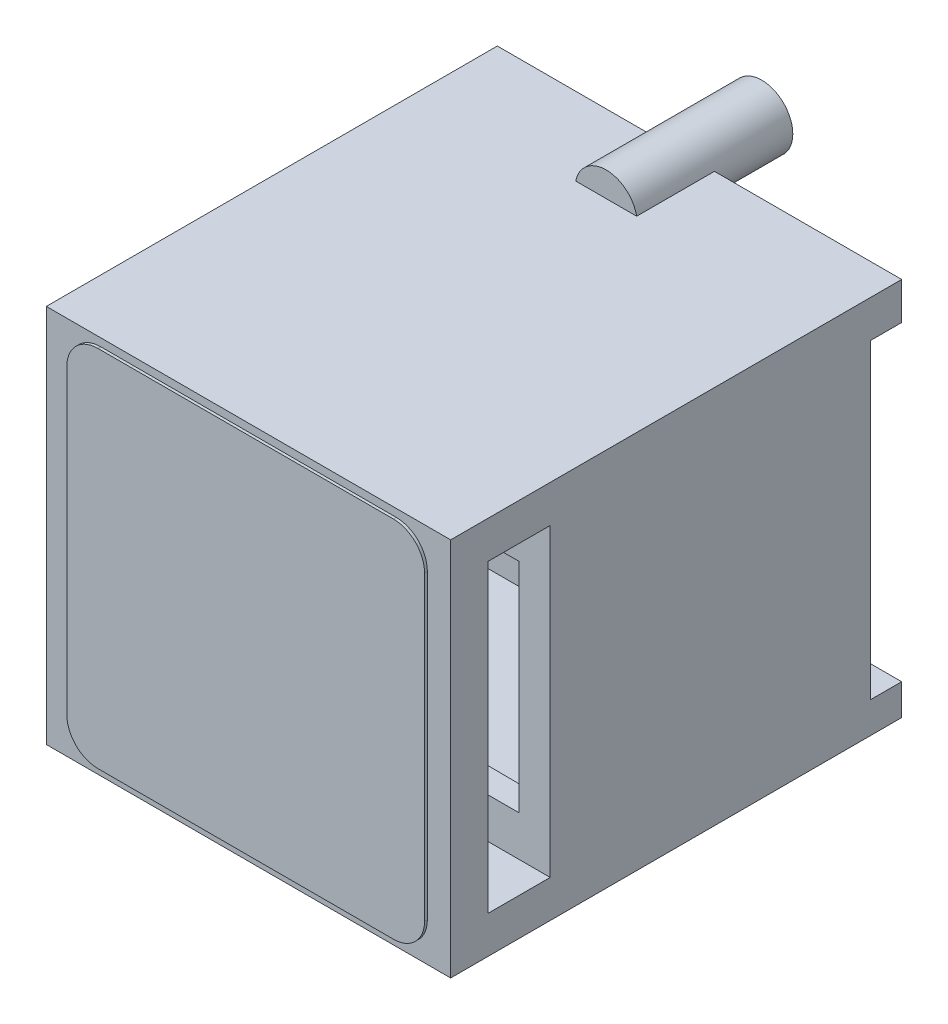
ISO-10303-21;
HEADER;
FILE_DESCRIPTION(('STEP AP214'),'2;1');
FILE_NAME('part.step','',(''),(''),'','','');
FILE_SCHEMA(('AUTOMOTIVE_DESIGN { 1 0 10303 214 1 1 1 1 }'));
ENDSEC;
DATA;
#1=APPLICATION_CONTEXT('core data for automotive mechanical design processes');
#2=APPLICATION_PROTOCOL_DEFINITION('international standard','automotive_design',2000,#1);
#3=PRODUCT_CONTEXT('',#1,'mechanical');
#4=PRODUCT('Part','Part','',(#3));
#5=PRODUCT_RELATED_PRODUCT_CATEGORY('part','',(#4));
#6=PRODUCT_DEFINITION_FORMATION('','',#4);
#7=PRODUCT_DEFINITION_CONTEXT('part definition',#1,'design');
#8=PRODUCT_DEFINITION('design','',#6,#7);
#9=PRODUCT_DEFINITION_SHAPE('','',#8);
#10=(LENGTH_UNIT() NAMED_UNIT(*) SI_UNIT(.MILLI.,.METRE.));
#11=(NAMED_UNIT(*) PLANE_ANGLE_UNIT() SI_UNIT($,.RADIAN.));
#12=(NAMED_UNIT(*) SI_UNIT($,.STERADIAN.) SOLID_ANGLE_UNIT());
#13=UNCERTAINTY_MEASURE_WITH_UNIT(LENGTH_MEASURE(1.E-05),#10,'distance_accuracy_value','');
#14=(GEOMETRIC_REPRESENTATION_CONTEXT(3) GLOBAL_UNCERTAINTY_ASSIGNED_CONTEXT((#13)) GLOBAL_UNIT_ASSIGNED_CONTEXT((#10,
#11,#12)) REPRESENTATION_CONTEXT('',''));
#15=CARTESIAN_POINT('',(0.,0.,0.));
#16=DIRECTION('',(0.,0.,1.));
#17=DIRECTION('',(1.,0.,0.));
#18=AXIS2_PLACEMENT_3D('',#15,#16,#17);
#19=CARTESIAN_POINT('',(-34.1053326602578,6.14397743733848,63.39));
#20=DIRECTION('',(0.,0.,-1.));
#21=DIRECTION('',(-1.,0.,0.));
#22=AXIS2_PLACEMENT_3D('',#19,#20,#21);
#23=CYLINDRICAL_SURFACE('',#22,1.);
#24=CARTESIAN_POINT('',(-34.1053326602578,6.14397743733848,63.3));
#25=DIRECTION('',(0.,0.,-1.));
#26=DIRECTION('',(1.,0.,0.));
#27=AXIS2_PLACEMENT_3D('',#24,#25,#26);
#28=CIRCLE('',#27,1.);
#29=CARTESIAN_POINT('',(-35.1053326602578,6.14397743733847,63.3));
#30=VERTEX_POINT('',#29);
#31=CARTESIAN_POINT('',(-34.1053326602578,7.14397743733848,63.3));
#32=VERTEX_POINT('',#31);
#33=EDGE_CURVE('P0_E130',#30,#32,#28,.T.);
#34=ORIENTED_EDGE('',*,*,#33,.F.);
#35=DIRECTION('',(0.,0.,-1.));
#36=VECTOR('',#35,1.);
#37=CARTESIAN_POINT('',(-35.1053326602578,6.14397743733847,63.39));
#38=LINE('',#37,#36);
#39=CARTESIAN_POINT('',(-35.1053326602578,6.14397743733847,63.39));
#40=VERTEX_POINT('',#39);
#41=EDGE_CURVE('P0_E11',#40,#30,#38,.T.);
#42=ORIENTED_EDGE('',*,*,#41,.F.);
#43=CARTESIAN_POINT('',(-34.1053326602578,6.14397743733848,63.39));
#44=DIRECTION('',(0.,0.,-1.));
#45=DIRECTION('',(1.,0.,0.));
#46=AXIS2_PLACEMENT_3D('',#43,#44,#45);
#47=CIRCLE('',#46,1.);
#48=CARTESIAN_POINT('',(-34.1053326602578,7.14397743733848,63.39));
#49=VERTEX_POINT('',#48);
#50=EDGE_CURVE('P0_E150',#40,#49,#47,.T.);
#51=ORIENTED_EDGE('',*,*,#50,.T.);
#52=DIRECTION('',(0.,0.,-1.));
#53=VECTOR('',#52,1.);
#54=CARTESIAN_POINT('',(-34.1053326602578,7.14397743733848,63.39));
#55=LINE('',#54,#53);
#56=EDGE_CURVE('P0_E36',#49,#32,#55,.T.);
#57=ORIENTED_EDGE('',*,*,#56,.T.);
#58=EDGE_LOOP('',(#34,#42,#51,#57));
#59=FACE_BOUND('',#58,.T.);
#60=ADVANCED_FACE('P0_F33',(#59),#23,.T.);
#61=CARTESIAN_POINT('',(-35.1053326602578,6.14397743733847,63.39));
#62=DIRECTION('',(-1.,0.,0.));
#63=DIRECTION('',(0.,0.,1.));
#64=AXIS2_PLACEMENT_3D('',#61,#62,#63);
#65=PLANE('',#64);
#66=DIRECTION('',(0.,1.,0.));
#67=VECTOR('',#66,1.);
#68=CARTESIAN_POINT('',(-35.1053326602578,6.14397743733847,63.3));
#69=LINE('',#68,#67);
#70=CARTESIAN_POINT('',(-35.1053326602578,-3.55602256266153,63.3));
#71=VERTEX_POINT('',#70);
#72=EDGE_CURVE('P0_E148',#71,#30,#69,.T.);
#73=ORIENTED_EDGE('',*,*,#72,.F.);
#74=DIRECTION('',(0.,0.,-1.));
#75=VECTOR('',#74,1.);
#76=CARTESIAN_POINT('',(-35.1053326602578,-3.55602256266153,63.39));
#77=LINE('',#76,#75);
#78=CARTESIAN_POINT('',(-35.1053326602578,-3.55602256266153,63.39));
#79=VERTEX_POINT('',#78);
#80=EDGE_CURVE('P0_E42',#79,#71,#77,.T.);
#81=ORIENTED_EDGE('',*,*,#80,.F.);
#82=DIRECTION('',(0.,1.,0.));
#83=VECTOR('',#82,1.);
#84=CARTESIAN_POINT('',(-35.1053326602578,6.14397743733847,63.39));
#85=LINE('',#84,#83);
#86=EDGE_CURVE('P0_E120',#79,#40,#85,.T.);
#87=ORIENTED_EDGE('',*,*,#86,.T.);
#88=ORIENTED_EDGE('',*,*,#41,.T.);
#89=EDGE_LOOP('',(#73,#81,#87,#88));
#90=FACE_BOUND('',#89,.T.);
#91=ADVANCED_FACE('P0_F162',(#90),#65,.T.);
#92=CARTESIAN_POINT('',(-34.1053326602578,-3.55602256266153,63.39));
#93=DIRECTION('',(0.,0.,-1.));
#94=DIRECTION('',(-1.,0.,0.));
#95=AXIS2_PLACEMENT_3D('',#92,#93,#94);
#96=CYLINDRICAL_SURFACE('',#95,1.);
#97=CARTESIAN_POINT('',(-34.1053326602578,-3.55602256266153,63.3));
#98=DIRECTION('',(0.,0.,-1.));
#99=DIRECTION('',(-1.,0.,0.));
#100=AXIS2_PLACEMENT_3D('',#97,#98,#99);
#101=CIRCLE('',#100,1.);
#102=CARTESIAN_POINT('',(-34.1053326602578,-4.55602256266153,63.3));
#103=VERTEX_POINT('',#102);
#104=EDGE_CURVE('P0_E107',#103,#71,#101,.T.);
#105=ORIENTED_EDGE('',*,*,#104,.F.);
#106=DIRECTION('',(0.,0.,-1.));
#107=VECTOR('',#106,1.);
#108=CARTESIAN_POINT('',(-34.1053326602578,-4.55602256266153,63.39));
#109=LINE('',#108,#107);
#110=CARTESIAN_POINT('',(-34.1053326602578,-4.55602256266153,63.39));
#111=VERTEX_POINT('',#110);
#112=EDGE_CURVE('P0_E102',#111,#103,#109,.T.);
#113=ORIENTED_EDGE('',*,*,#112,.F.);
#114=CARTESIAN_POINT('',(-34.1053326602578,-3.55602256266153,63.39));
#115=DIRECTION('',(0.,0.,-1.));
#116=DIRECTION('',(-1.,0.,0.));
#117=AXIS2_PLACEMENT_3D('',#114,#115,#116);
#118=CIRCLE('',#117,1.);
#119=EDGE_CURVE('P0_E105',#111,#79,#118,.T.);
#120=ORIENTED_EDGE('',*,*,#119,.T.);
#121=ORIENTED_EDGE('',*,*,#80,.T.);
#122=EDGE_LOOP('',(#105,#113,#120,#121));
#123=FACE_BOUND('',#122,.T.);
#124=ADVANCED_FACE('P0_F104',(#123),#96,.T.);
#125=CARTESIAN_POINT('',(-24.6053326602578,-4.55602256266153,63.39));
#126=DIRECTION('',(0.,-1.,0.));
#127=DIRECTION('',(0.,0.,-1.));
#128=AXIS2_PLACEMENT_3D('',#125,#126,#127);
#129=PLANE('',#128);
#130=DIRECTION('',(-1.,0.,0.));
#131=VECTOR('',#130,1.);
#132=CARTESIAN_POINT('',(-24.6053326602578,-4.55602256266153,63.3));
#133=LINE('',#132,#131);
#134=CARTESIAN_POINT('',(-24.6053326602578,-4.55602256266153,63.3));
#135=VERTEX_POINT('',#134);
#136=EDGE_CURVE('P0_E145',#135,#103,#133,.T.);
#137=ORIENTED_EDGE('',*,*,#136,.F.);
#138=DIRECTION('',(0.,0.,-1.));
#139=VECTOR('',#138,1.);
#140=CARTESIAN_POINT('',(-24.6053326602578,-4.55602256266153,63.39));
#141=LINE('',#140,#139);
#142=CARTESIAN_POINT('',(-24.6053326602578,-4.55602256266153,63.39));
#143=VERTEX_POINT('',#142);
#144=EDGE_CURVE('P0_E112',#143,#135,#141,.T.);
#145=ORIENTED_EDGE('',*,*,#144,.F.);
#146=DIRECTION('',(-1.,0.,0.));
#147=VECTOR('',#146,1.);
#148=CARTESIAN_POINT('',(-24.6053326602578,-4.55602256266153,63.39));
#149=LINE('',#148,#147);
#150=EDGE_CURVE('P0_E118',#143,#111,#149,.T.);
#151=ORIENTED_EDGE('',*,*,#150,.T.);
#152=ORIENTED_EDGE('',*,*,#112,.T.);
#153=EDGE_LOOP('',(#137,#145,#151,#152));
#154=FACE_BOUND('',#153,.T.);
#155=ADVANCED_FACE('P0_F122',(#154),#129,.T.);
#156=CARTESIAN_POINT('',(-24.6053326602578,-3.55602256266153,63.39));
#157=DIRECTION('',(0.,0.,-1.));
#158=DIRECTION('',(-1.,0.,0.));
#159=AXIS2_PLACEMENT_3D('',#156,#157,#158);
#160=CYLINDRICAL_SURFACE('',#159,0.999999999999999);
#161=CARTESIAN_POINT('',(-24.6053326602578,-3.55602256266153,63.3));
#162=DIRECTION('',(0.,0.,-1.));
#163=DIRECTION('',(-1.,0.,0.));
#164=AXIS2_PLACEMENT_3D('',#161,#162,#163);
#165=CIRCLE('',#164,0.999999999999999);
#166=CARTESIAN_POINT('',(-23.6053326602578,-3.55602256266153,63.3));
#167=VERTEX_POINT('',#166);
#168=EDGE_CURVE('P0_E142',#167,#135,#165,.T.);
#169=ORIENTED_EDGE('',*,*,#168,.F.);
#170=DIRECTION('',(0.,0.,-1.));
#171=VECTOR('',#170,1.);
#172=CARTESIAN_POINT('',(-23.6053326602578,-3.55602256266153,63.39));
#173=LINE('',#172,#171);
#174=CARTESIAN_POINT('',(-23.6053326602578,-3.55602256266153,63.39));
#175=VERTEX_POINT('',#174);
#176=EDGE_CURVE('P0_E154',#175,#167,#173,.T.);
#177=ORIENTED_EDGE('',*,*,#176,.F.);
#178=CARTESIAN_POINT('',(-24.6053326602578,-3.55602256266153,63.39));
#179=DIRECTION('',(0.,0.,-1.));
#180=DIRECTION('',(-1.,0.,0.));
#181=AXIS2_PLACEMENT_3D('',#178,#179,#180);
#182=CIRCLE('',#181,0.999999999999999);
#183=EDGE_CURVE('P0_E123',#175,#143,#182,.T.);
#184=ORIENTED_EDGE('',*,*,#183,.T.);
#185=ORIENTED_EDGE('',*,*,#144,.T.);
#186=EDGE_LOOP('',(#169,#177,#184,#185));
#187=FACE_BOUND('',#186,.T.);
#188=ADVANCED_FACE('P0_F175',(#187),#160,.T.);
#189=CARTESIAN_POINT('',(-23.6053326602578,6.14397743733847,63.39));
#190=DIRECTION('',(1.,0.,0.));
#191=DIRECTION('',(0.,1.,0.));
#192=AXIS2_PLACEMENT_3D('',#189,#190,#191);
#193=PLANE('',#192);
#194=DIRECTION('',(0.,-1.,0.));
#195=VECTOR('',#194,1.);
#196=CARTESIAN_POINT('',(-23.6053326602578,6.14397743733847,63.3));
#197=LINE('',#196,#195);
#198=CARTESIAN_POINT('',(-23.6053326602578,6.14397743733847,63.3));
#199=VERTEX_POINT('',#198);
#200=EDGE_CURVE('P0_E139',#199,#167,#197,.T.);
#201=ORIENTED_EDGE('',*,*,#200,.F.);
#202=DIRECTION('',(0.,0.,-1.));
#203=VECTOR('',#202,1.);
#204=CARTESIAN_POINT('',(-23.6053326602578,6.14397743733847,63.39));
#205=LINE('',#204,#203);
#206=CARTESIAN_POINT('',(-23.6053326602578,6.14397743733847,63.39));
#207=VERTEX_POINT('',#206);
#208=EDGE_CURVE('P0_E156',#207,#199,#205,.T.);
#209=ORIENTED_EDGE('',*,*,#208,.F.);
#210=DIRECTION('',(0.,-1.,0.));
#211=VECTOR('',#210,1.);
#212=CARTESIAN_POINT('',(-23.6053326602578,6.14397743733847,63.39));
#213=LINE('',#212,#211);
#214=EDGE_CURVE('P0_E125',#207,#175,#213,.T.);
#215=ORIENTED_EDGE('',*,*,#214,.T.);
#216=ORIENTED_EDGE('',*,*,#176,.T.);
#217=EDGE_LOOP('',(#201,#209,#215,#216));
#218=FACE_BOUND('',#217,.T.);
#219=ADVANCED_FACE('P0_F178',(#218),#193,.T.);
#220=CARTESIAN_POINT('',(-24.6053326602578,6.14397743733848,63.39));
#221=DIRECTION('',(0.,0.,-1.));
#222=DIRECTION('',(-1.,0.,0.));
#223=AXIS2_PLACEMENT_3D('',#220,#221,#222);
#224=CYLINDRICAL_SURFACE('',#223,1.);
#225=CARTESIAN_POINT('',(-24.6053326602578,6.14397743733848,63.3));
#226=DIRECTION('',(0.,0.,-1.));
#227=DIRECTION('',(-1.,0.,0.));
#228=AXIS2_PLACEMENT_3D('',#225,#226,#227);
#229=CIRCLE('',#228,1.);
#230=CARTESIAN_POINT('',(-24.6053326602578,7.14397743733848,63.3));
#231=VERTEX_POINT('',#230);
#232=EDGE_CURVE('P0_E136',#231,#199,#229,.T.);
#233=ORIENTED_EDGE('',*,*,#232,.F.);
#234=DIRECTION('',(0.,0.,-1.));
#235=VECTOR('',#234,1.);
#236=CARTESIAN_POINT('',(-24.6053326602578,7.14397743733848,63.39));
#237=LINE('',#236,#235);
#238=CARTESIAN_POINT('',(-24.6053326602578,7.14397743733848,63.39));
#239=VERTEX_POINT('',#238);
#240=EDGE_CURVE('P0_E157',#239,#231,#237,.T.);
#241=ORIENTED_EDGE('',*,*,#240,.F.);
#242=CARTESIAN_POINT('',(-24.6053326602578,6.14397743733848,63.39));
#243=DIRECTION('',(0.,0.,-1.));
#244=DIRECTION('',(-1.,0.,0.));
#245=AXIS2_PLACEMENT_3D('',#242,#243,#244);
#246=CIRCLE('',#245,1.);
#247=EDGE_CURVE('P0_E253',#239,#207,#246,.T.);
#248=ORIENTED_EDGE('',*,*,#247,.T.);
#249=ORIENTED_EDGE('',*,*,#208,.T.);
#250=EDGE_LOOP('',(#233,#241,#248,#249));
#251=FACE_BOUND('',#250,.T.);
#252=ADVANCED_FACE('P0_F182',(#251),#224,.T.);
#253=CARTESIAN_POINT('',(-24.6053326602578,7.14397743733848,63.39));
#254=DIRECTION('',(0.,1.,0.));
#255=DIRECTION('',(0.,0.,1.));
#256=AXIS2_PLACEMENT_3D('',#253,#254,#255);
#257=PLANE('',#256);
#258=DIRECTION('',(1.,0.,0.));
#259=VECTOR('',#258,1.);
#260=CARTESIAN_POINT('',(-24.6053326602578,7.14397743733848,63.3));
#261=LINE('',#260,#259);
#262=EDGE_CURVE('P0_E133',#32,#231,#261,.T.);
#263=ORIENTED_EDGE('',*,*,#262,.F.);
#264=ORIENTED_EDGE('',*,*,#56,.F.);
#265=DIRECTION('',(1.,0.,0.));
#266=VECTOR('',#265,1.);
#267=CARTESIAN_POINT('',(-24.6053326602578,7.14397743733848,63.39));
#268=LINE('',#267,#266);
#269=EDGE_CURVE('P0_E254',#49,#239,#268,.T.);
#270=ORIENTED_EDGE('',*,*,#269,.T.);
#271=ORIENTED_EDGE('',*,*,#240,.T.);
#272=EDGE_LOOP('',(#263,#264,#270,#271));
#273=FACE_BOUND('',#272,.T.);
#274=ADVANCED_FACE('P0_F159',(#273),#257,.T.);
#275=CARTESIAN_POINT('',(-34.1053326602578,6.14397743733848,63.39));
#276=DIRECTION('',(0.,0.,1.));
#277=DIRECTION('',(1.,0.,0.));
#278=AXIS2_PLACEMENT_3D('',#275,#276,#277);
#279=PLANE('',#278);
#280=ORIENTED_EDGE('',*,*,#50,.F.);
#281=ORIENTED_EDGE('',*,*,#86,.F.);
#282=ORIENTED_EDGE('',*,*,#119,.F.);
#283=ORIENTED_EDGE('',*,*,#150,.F.);
#284=ORIENTED_EDGE('',*,*,#183,.F.);
#285=ORIENTED_EDGE('',*,*,#214,.F.);
#286=ORIENTED_EDGE('',*,*,#247,.F.);
#287=ORIENTED_EDGE('',*,*,#269,.F.);
#288=EDGE_LOOP('',(#280,#281,#282,#283,#284,#285,#286,#287));
#289=FACE_BOUND('',#288,.T.);
#290=ADVANCED_FACE('P0_F116',(#289),#279,.T.);
#291=CARTESIAN_POINT('',(-34.1053326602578,6.14397743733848,63.3));
#292=DIRECTION('',(0.,0.,1.));
#293=DIRECTION('',(1.,0.,0.));
#294=AXIS2_PLACEMENT_3D('',#291,#292,#293);
#295=PLANE('',#294);
#296=ORIENTED_EDGE('',*,*,#33,.T.);
#297=ORIENTED_EDGE('',*,*,#262,.T.);
#298=ORIENTED_EDGE('',*,*,#232,.T.);
#299=ORIENTED_EDGE('',*,*,#200,.T.);
#300=ORIENTED_EDGE('',*,*,#168,.T.);
#301=ORIENTED_EDGE('',*,*,#136,.T.);
#302=ORIENTED_EDGE('',*,*,#104,.T.);
#303=ORIENTED_EDGE('',*,*,#72,.T.);
#304=EDGE_LOOP('',(#296,#297,#298,#299,#300,#301,#302,#303));
#305=FACE_BOUND('',#304,.T.);
#306=ADVANCED_FACE('P0_F161',(#305),#295,.F.);
#307=CLOSED_SHELL('',(#60,#91,#124,#155,#188,#219,#252,#274,#290,#306));
#308=MANIFOLD_SOLID_BREP('P0_B2',#307);
#309=CARTESIAN_POINT('',(-22.8553326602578,7.39397743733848,56.3));
#310=DIRECTION('',(0.,-1.,0.));
#311=DIRECTION('',(1.,0.,0.));
#312=AXIS2_PLACEMENT_3D('',#309,#310,#311);
#313=PLANE('',#312);
#314=DIRECTION('',(1.,0.,0.));
#315=VECTOR('',#314,1.);
#316=CARTESIAN_POINT('',(-22.8553326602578,7.39397743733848,51.3));
#317=LINE('',#316,#315);
#318=CARTESIAN_POINT('',(-30.8351285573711,7.39397743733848,51.3));
#319=VERTEX_POINT('',#318);
#320=CARTESIAN_POINT('',(-28.8755367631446,7.39397743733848,51.3));
#321=VERTEX_POINT('',#320);
#322=EDGE_CURVE('P1_E27',#319,#321,#317,.T.);
#323=ORIENTED_EDGE('',*,*,#322,.T.);
#324=DIRECTION('',(0.,0.,1.));
#325=VECTOR('',#324,1.);
#326=CARTESIAN_POINT('',(-28.8755367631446,7.39397743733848,56.3));
#327=LINE('',#326,#325);
#328=CARTESIAN_POINT('',(-28.8755367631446,7.39397743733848,48.8));
#329=VERTEX_POINT('',#328);
#330=EDGE_CURVE('P1_E11',#321,#329,#327,.F.);
#331=ORIENTED_EDGE('',*,*,#330,.T.);
#332=DIRECTION('',(1.,0.,0.));
#333=VECTOR('',#332,1.);
#334=CARTESIAN_POINT('',(-22.8553326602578,7.39397743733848,48.8));
#335=LINE('',#334,#333);
#336=CARTESIAN_POINT('',(-22.8553326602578,7.39397743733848,48.8));
#337=VERTEX_POINT('',#336);
#338=EDGE_CURVE('P1_E437',#329,#337,#335,.T.);
#339=ORIENTED_EDGE('',*,*,#338,.T.);
#340=DIRECTION('',(0.,0.,1.));
#341=VECTOR('',#340,1.);
#342=CARTESIAN_POINT('',(-22.8553326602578,7.39397743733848,56.3));
#343=LINE('',#342,#341);
#344=CARTESIAN_POINT('',(-22.8553326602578,7.39397743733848,63.3));
#345=VERTEX_POINT('',#344);
#346=EDGE_CURVE('P1_E449',#337,#345,#343,.T.);
#347=ORIENTED_EDGE('',*,*,#346,.T.);
#348=DIRECTION('',(1.,0.,0.));
#349=VECTOR('',#348,1.);
#350=CARTESIAN_POINT('',(-22.8553326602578,7.39397743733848,63.3));
#351=LINE('',#350,#349);
#352=CARTESIAN_POINT('',(-35.8553326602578,7.39397743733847,63.3));
#353=VERTEX_POINT('',#352);
#354=EDGE_CURVE('P1_E523',#345,#353,#351,.F.);
#355=ORIENTED_EDGE('',*,*,#354,.T.);
#356=DIRECTION('',(0.,0.,1.));
#357=VECTOR('',#356,1.);
#358=CARTESIAN_POINT('',(-35.8553326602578,7.39397743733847,56.3));
#359=LINE('',#358,#357);
#360=CARTESIAN_POINT('',(-35.8553326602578,7.39397743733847,48.8));
#361=VERTEX_POINT('',#360);
#362=EDGE_CURVE('P1_E463',#353,#361,#359,.F.);
#363=ORIENTED_EDGE('',*,*,#362,.T.);
#364=DIRECTION('',(1.,0.,0.));
#365=VECTOR('',#364,1.);
#366=CARTESIAN_POINT('',(-22.8553326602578,7.39397743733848,48.8));
#367=LINE('',#366,#365);
#368=CARTESIAN_POINT('',(-30.8351285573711,7.39397743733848,48.8));
#369=VERTEX_POINT('',#368);
#370=EDGE_CURVE('P1_E459',#361,#369,#367,.T.);
#371=ORIENTED_EDGE('',*,*,#370,.T.);
#372=DIRECTION('',(0.,0.,1.));
#373=VECTOR('',#372,1.);
#374=CARTESIAN_POINT('',(-30.8351285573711,7.39397743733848,56.3));
#375=LINE('',#374,#373);
#376=EDGE_CURVE('P1_E455',#369,#319,#375,.T.);
#377=ORIENTED_EDGE('',*,*,#376,.T.);
#378=EDGE_LOOP('',(#323,#331,#339,#347,#355,#363,#371,#377));
#379=FACE_BOUND('',#378,.T.);
#380=ADVANCED_FACE('P1_F16',(#379),#313,.T.);
#381=CARTESIAN_POINT('',(-29.8553326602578,7.19397743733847,46.3));
#382=DIRECTION('',(0.,0.,1.));
#383=DIRECTION('',(1.,0.,0.));
#384=AXIS2_PLACEMENT_3D('',#381,#382,#383);
#385=CYLINDRICAL_SURFACE('',#384,0.999999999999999);
#386=CARTESIAN_POINT('',(-29.8553326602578,7.19397743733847,46.3));
#387=DIRECTION('',(0.,0.,1.));
#388=DIRECTION('',(1.,0.,0.));
#389=AXIS2_PLACEMENT_3D('',#386,#387,#388);
#390=CIRCLE('',#389,0.999999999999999);
#391=CARTESIAN_POINT('',(-28.8553326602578,7.19397743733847,46.3));
#392=VERTEX_POINT('',#391);
#393=EDGE_CURVE('P1_E691',#392,#392,#390,.T.);
#394=ORIENTED_EDGE('',*,*,#393,.F.);
#395=EDGE_LOOP('',(#394));
#396=FACE_BOUND('',#395,.T.);
#397=ORIENTED_EDGE('',*,*,#330,.F.);
#398=CARTESIAN_POINT('',(-29.8553326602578,7.19397743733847,51.3));
#399=DIRECTION('',(0.,0.,1.));
#400=DIRECTION('',(1.,0.,0.));
#401=AXIS2_PLACEMENT_3D('',#398,#399,#400);
#402=CIRCLE('',#401,0.999999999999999);
#403=EDGE_CURVE('P1_E35',#319,#321,#402,.F.);
#404=ORIENTED_EDGE('',*,*,#403,.F.);
#405=ORIENTED_EDGE('',*,*,#376,.F.);
#406=CARTESIAN_POINT('',(-29.8553326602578,7.19397743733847,48.8));
#407=DIRECTION('',(0.,0.,1.));
#408=DIRECTION('',(1.,0.,0.));
#409=AXIS2_PLACEMENT_3D('',#406,#407,#408);
#410=CIRCLE('',#409,0.999999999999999);
#411=EDGE_CURVE('P1_E441',#329,#369,#410,.F.);
#412=ORIENTED_EDGE('',*,*,#411,.F.);
#413=EDGE_LOOP('',(#397,#404,#405,#412));
#414=FACE_BOUND('',#413,.T.);
#415=ADVANCED_FACE('P1_F452',(#396,#414),#385,.F.);
#416=CARTESIAN_POINT('',(-29.8553326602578,7.19397743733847,51.3));
#417=DIRECTION('',(0.,0.,-1.));
#418=DIRECTION('',(-1.,0.,0.));
#419=AXIS2_PLACEMENT_3D('',#416,#417,#418);
#420=PLANE('',#419);
#421=ORIENTED_EDGE('',*,*,#322,.F.);
#422=ORIENTED_EDGE('',*,*,#403,.T.);
#423=EDGE_LOOP('',(#421,#422));
#424=FACE_BOUND('',#423,.T.);
#425=ADVANCED_FACE('P1_F486',(#424),#420,.T.);
#426=CARTESIAN_POINT('',(-35.8553326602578,7.39397743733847,48.8));
#427=DIRECTION('',(0.,0.,-1.));
#428=DIRECTION('',(-1.,0.,0.));
#429=AXIS2_PLACEMENT_3D('',#426,#427,#428);
#430=PLANE('',#429);
#431=DIRECTION('',(-1.,0.,0.));
#432=VECTOR('',#431,1.);
#433=CARTESIAN_POINT('',(-35.8553326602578,-3.80602256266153,48.8));
#434=LINE('',#433,#432);
#435=CARTESIAN_POINT('',(-25.8553326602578,-3.80602256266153,48.8));
#436=VERTEX_POINT('',#435);
#437=CARTESIAN_POINT('',(-22.8553326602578,-3.80602256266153,48.8));
#438=VERTEX_POINT('',#437);
#439=EDGE_CURVE('P1_E432',#436,#438,#434,.F.);
#440=ORIENTED_EDGE('',*,*,#439,.F.);
#441=DIRECTION('',(0.,1.,0.));
#442=VECTOR('',#441,1.);
#443=CARTESIAN_POINT('',(-25.8553326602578,7.39397743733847,48.8));
#444=LINE('',#443,#442);
#445=CARTESIAN_POINT('',(-25.8553326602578,6.19397743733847,48.8));
#446=VERTEX_POINT('',#445);
#447=EDGE_CURVE('P1_E500',#446,#436,#444,.F.);
#448=ORIENTED_EDGE('',*,*,#447,.F.);
#449=DIRECTION('',(-1.,0.,0.));
#450=VECTOR('',#449,1.);
#451=CARTESIAN_POINT('',(-35.8553326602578,6.19397743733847,48.8));
#452=LINE('',#451,#450);
#453=CARTESIAN_POINT('',(-22.8553326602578,6.19397743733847,48.8));
#454=VERTEX_POINT('',#453);
#455=EDGE_CURVE('P1_E504',#454,#446,#452,.T.);
#456=ORIENTED_EDGE('',*,*,#455,.F.);
#457=DIRECTION('',(0.,1.,0.));
#458=VECTOR('',#457,1.);
#459=CARTESIAN_POINT('',(-22.8553326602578,7.39397743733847,48.8));
#460=LINE('',#459,#458);
#461=EDGE_CURVE('P1_E445',#337,#454,#460,.F.);
#462=ORIENTED_EDGE('',*,*,#461,.F.);
#463=ORIENTED_EDGE('',*,*,#338,.F.);
#464=ORIENTED_EDGE('',*,*,#411,.T.);
#465=ORIENTED_EDGE('',*,*,#370,.F.);
#466=DIRECTION('',(0.,1.,0.));
#467=VECTOR('',#466,1.);
#468=CARTESIAN_POINT('',(-35.8553326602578,7.39397743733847,48.8));
#469=LINE('',#468,#467);
#470=CARTESIAN_POINT('',(-35.8553326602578,6.19397743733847,48.8));
#471=VERTEX_POINT('',#470);
#472=EDGE_CURVE('P1_E516',#471,#361,#469,.T.);
#473=ORIENTED_EDGE('',*,*,#472,.F.);
#474=DIRECTION('',(-1.,0.,0.));
#475=VECTOR('',#474,1.);
#476=CARTESIAN_POINT('',(-35.8553326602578,6.19397743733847,48.8));
#477=LINE('',#476,#475);
#478=CARTESIAN_POINT('',(-33.8553326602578,6.19397743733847,48.8));
#479=VERTEX_POINT('',#478);
#480=EDGE_CURVE('P1_E518',#479,#471,#477,.T.);
#481=ORIENTED_EDGE('',*,*,#480,.F.);
#482=DIRECTION('',(0.,1.,0.));
#483=VECTOR('',#482,1.);
#484=CARTESIAN_POINT('',(-33.8553326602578,7.39397743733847,48.8));
#485=LINE('',#484,#483);
#486=CARTESIAN_POINT('',(-33.8553326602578,-3.80602256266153,48.8));
#487=VERTEX_POINT('',#486);
#488=EDGE_CURVE('P1_E593',#487,#479,#485,.T.);
#489=ORIENTED_EDGE('',*,*,#488,.F.);
#490=DIRECTION('',(-1.,0.,0.));
#491=VECTOR('',#490,1.);
#492=CARTESIAN_POINT('',(-35.8553326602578,-3.80602256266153,48.8));
#493=LINE('',#492,#491);
#494=CARTESIAN_POINT('',(-35.8553326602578,-3.80602256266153,48.8));
#495=VERTEX_POINT('',#494);
#496=EDGE_CURVE('P1_E609',#495,#487,#493,.F.);
#497=ORIENTED_EDGE('',*,*,#496,.F.);
#498=DIRECTION('',(0.,1.,0.));
#499=VECTOR('',#498,1.);
#500=CARTESIAN_POINT('',(-35.8553326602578,7.39397743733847,48.8));
#501=LINE('',#500,#499);
#502=CARTESIAN_POINT('',(-35.8553326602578,-4.80602256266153,48.8));
#503=VERTEX_POINT('',#502);
#504=EDGE_CURVE('P1_E507',#503,#495,#501,.T.);
#505=ORIENTED_EDGE('',*,*,#504,.F.);
#506=DIRECTION('',(-1.,0.,0.));
#507=VECTOR('',#506,1.);
#508=CARTESIAN_POINT('',(-35.8553326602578,-4.80602256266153,48.8));
#509=LINE('',#508,#507);
#510=CARTESIAN_POINT('',(-30.8553326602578,-4.80602256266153,48.8));
#511=VERTEX_POINT('',#510);
#512=EDGE_CURVE('P1_E505',#511,#503,#509,.T.);
#513=ORIENTED_EDGE('',*,*,#512,.F.);
#514=CARTESIAN_POINT('',(-30.8553326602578,-4.80602256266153,48.8));
#515=CARTESIAN_POINT('',(-30.8553326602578,-4.61501175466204,48.8));
#516=CARTESIAN_POINT('',(-30.7851209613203,-4.43792785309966,48.8));
#517=CARTESIAN_POINT('',(-30.7085920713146,-4.24491109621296,48.8));
#518=CARTESIAN_POINT('',(-30.5624394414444,-4.09891578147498,48.8));
#519=CARTESIAN_POINT('',(-30.4155412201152,-3.95217567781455,48.8));
#520=CARTESIAN_POINT('',(-30.2234273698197,-3.8762342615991,48.8));
#521=CARTESIAN_POINT('',(-30.0458083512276,-3.80602256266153,48.8));
#522=CARTESIAN_POINT('',(-29.8553326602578,-3.80602256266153,48.8));
#523=B_SPLINE_CURVE_WITH_KNOTS('',2,(#514,#515,#516,#517,#518,#519,#520,#521,#522),
.UNSPECIFIED.,.F.,.F.,(3,2,2,2,3),(0.,0.25,0.5,0.75,1.),.UNSPECIFIED.);
#524=CARTESIAN_POINT('',(-29.8553326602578,-3.80602256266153,48.8));
#525=VERTEX_POINT('',#524);
#526=EDGE_CURVE('P1_E921',#511,#525,#523,.T.);
#527=ORIENTED_EDGE('',*,*,#526,.T.);
#528=CARTESIAN_POINT('',(-29.8553326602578,-3.80602256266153,48.8));
#529=CARTESIAN_POINT('',(-29.6643218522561,-3.80602256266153,48.8));
#530=CARTESIAN_POINT('',(-29.487237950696,-3.8762342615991,48.8));
#531=CARTESIAN_POINT('',(-29.2942211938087,-3.95276315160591,48.8));
#532=CARTESIAN_POINT('',(-29.1482258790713,-4.09891578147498,48.8));
#533=CARTESIAN_POINT('',(-29.0014857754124,-4.24581400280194,48.8));
#534=CARTESIAN_POINT('',(-28.9255443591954,-4.43792785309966,48.8));
#535=CARTESIAN_POINT('',(-28.8553326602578,-4.61554687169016,48.8));
#536=CARTESIAN_POINT('',(-28.8553326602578,-4.80602256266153,48.8));
#537=B_SPLINE_CURVE_WITH_KNOTS('',2,(#528,#529,#530,#531,#532,#533,#534,#535,#536),
.UNSPECIFIED.,.F.,.F.,(3,2,2,2,3),(0.,0.25,0.5,0.75,1.),.UNSPECIFIED.);
#538=CARTESIAN_POINT('',(-28.8553326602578,-4.80602256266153,48.8));
#539=VERTEX_POINT('',#538);
#540=EDGE_CURVE('P1_E469',#525,#539,#537,.T.);
#541=ORIENTED_EDGE('',*,*,#540,.T.);
#542=DIRECTION('',(-1.,0.,0.));
#543=VECTOR('',#542,1.);
#544=CARTESIAN_POINT('',(-35.8553326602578,-4.80602256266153,48.8));
#545=LINE('',#544,#543);
#546=CARTESIAN_POINT('',(-22.8553326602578,-4.80602256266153,48.8));
#547=VERTEX_POINT('',#546);
#548=EDGE_CURVE('P1_E508',#547,#539,#545,.T.);
#549=ORIENTED_EDGE('',*,*,#548,.F.);
#550=DIRECTION('',(0.,1.,0.));
#551=VECTOR('',#550,1.);
#552=CARTESIAN_POINT('',(-22.8553326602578,7.39397743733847,48.8));
#553=LINE('',#552,#551);
#554=EDGE_CURVE('P1_E499',#438,#547,#553,.F.);
#555=ORIENTED_EDGE('',*,*,#554,.F.);
#556=EDGE_LOOP('',(#440,#448,#456,#462,#463,#464,#465,#473,#481,#489,#497,#505,#513,#527,#541,
#549,#555));
#557=FACE_BOUND('',#556,.T.);
#558=ADVANCED_FACE('P1_F439',(#557),#430,.F.);
#559=CARTESIAN_POINT('',(-35.8553326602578,7.39397743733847,63.3));
#560=DIRECTION('',(-1.,0.,0.));
#561=DIRECTION('',(0.,-1.,0.));
#562=AXIS2_PLACEMENT_3D('',#559,#560,#561);
#563=PLANE('',#562);
#564=DIRECTION('',(0.,0.,1.));
#565=VECTOR('',#564,1.);
#566=CARTESIAN_POINT('',(-35.8553326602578,3.19397743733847,63.3));
#567=LINE('',#566,#565);
#568=CARTESIAN_POINT('',(-35.8553326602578,3.19397743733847,60.65));
#569=VERTEX_POINT('',#568);
#570=CARTESIAN_POINT('',(-35.8553326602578,3.19397743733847,62.65));
#571=VERTEX_POINT('',#570);
#572=EDGE_CURVE('P1_E528',#569,#571,#567,.T.);
#573=ORIENTED_EDGE('',*,*,#572,.F.);
#574=DIRECTION('',(0.,-1.,0.));
#575=VECTOR('',#574,1.);
#576=CARTESIAN_POINT('',(-35.8553326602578,-2.30602256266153,60.65));
#577=LINE('',#576,#575);
#578=CARTESIAN_POINT('',(-35.8553326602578,4.69397743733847,60.65));
#579=VERTEX_POINT('',#578);
#580=EDGE_CURVE('P1_E1148',#579,#569,#577,.T.);
#581=ORIENTED_EDGE('',*,*,#580,.F.);
#582=DIRECTION('',(0.,0.,1.));
#583=VECTOR('',#582,1.);
#584=CARTESIAN_POINT('',(-35.8553326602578,4.69397743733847,60.65));
#585=LINE('',#584,#583);
#586=CARTESIAN_POINT('',(-35.8553326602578,4.69397743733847,59.15));
#587=VERTEX_POINT('',#586);
#588=EDGE_CURVE('P1_E1105',#587,#579,#585,.T.);
#589=ORIENTED_EDGE('',*,*,#588,.F.);
#590=DIRECTION('',(0.,1.,0.));
#591=VECTOR('',#590,1.);
#592=CARTESIAN_POINT('',(-35.8553326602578,6.19397743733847,59.15));
#593=LINE('',#592,#591);
#594=CARTESIAN_POINT('',(-35.8553326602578,6.19397743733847,59.15));
#595=VERTEX_POINT('',#594);
#596=EDGE_CURVE('P1_E810',#595,#587,#593,.F.);
#597=ORIENTED_EDGE('',*,*,#596,.F.);
#598=DIRECTION('',(0.,0.,1.));
#599=VECTOR('',#598,1.);
#600=CARTESIAN_POINT('',(-35.8553326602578,6.19397743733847,63.3));
#601=LINE('',#600,#599);
#602=EDGE_CURVE('P1_E530',#471,#595,#601,.T.);
#603=ORIENTED_EDGE('',*,*,#602,.F.);
#604=ORIENTED_EDGE('',*,*,#472,.T.);
#605=ORIENTED_EDGE('',*,*,#362,.F.);
#606=DIRECTION('',(0.,-1.,0.));
#607=VECTOR('',#606,1.);
#608=CARTESIAN_POINT('',(-35.8553326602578,7.39397743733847,63.3));
#609=LINE('',#608,#607);
#610=CARTESIAN_POINT('',(-35.8553326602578,-4.80602256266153,63.3));
#611=VERTEX_POINT('',#610);
#612=EDGE_CURVE('P1_E536',#611,#353,#609,.F.);
#613=ORIENTED_EDGE('',*,*,#612,.F.);
#614=DIRECTION('',(0.,0.,1.));
#615=VECTOR('',#614,1.);
#616=CARTESIAN_POINT('',(-35.8553326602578,-4.80602256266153,63.3));
#617=LINE('',#616,#615);
#618=EDGE_CURVE('P1_E538',#503,#611,#617,.T.);
#619=ORIENTED_EDGE('',*,*,#618,.F.);
#620=ORIENTED_EDGE('',*,*,#504,.T.);
#621=DIRECTION('',(0.,0.,1.));
#622=VECTOR('',#621,1.);
#623=CARTESIAN_POINT('',(-35.8553326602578,-3.80602256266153,63.3));
#624=LINE('',#623,#622);
#625=CARTESIAN_POINT('',(-35.8553326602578,-3.80602256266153,59.15));
#626=VERTEX_POINT('',#625);
#627=EDGE_CURVE('P1_E534',#626,#495,#624,.F.);
#628=ORIENTED_EDGE('',*,*,#627,.F.);
#629=DIRECTION('',(0.,1.,0.));
#630=VECTOR('',#629,1.);
#631=CARTESIAN_POINT('',(-35.8553326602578,6.19397743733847,59.15));
#632=LINE('',#631,#630);
#633=CARTESIAN_POINT('',(-35.8553326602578,-2.30602256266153,59.15));
#634=VERTEX_POINT('',#633);
#635=EDGE_CURVE('P1_E1172',#634,#626,#632,.F.);
#636=ORIENTED_EDGE('',*,*,#635,.F.);
#637=DIRECTION('',(0.,0.,1.));
#638=VECTOR('',#637,1.);
#639=CARTESIAN_POINT('',(-35.8553326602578,-2.30602256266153,59.15));
#640=LINE('',#639,#638);
#641=CARTESIAN_POINT('',(-35.8553326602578,-2.30602256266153,60.65));
#642=VERTEX_POINT('',#641);
#643=EDGE_CURVE('P1_E1040',#642,#634,#640,.F.);
#644=ORIENTED_EDGE('',*,*,#643,.F.);
#645=DIRECTION('',(0.,-1.,0.));
#646=VECTOR('',#645,1.);
#647=CARTESIAN_POINT('',(-35.8553326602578,-2.30602256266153,60.65));
#648=LINE('',#647,#646);
#649=CARTESIAN_POINT('',(-35.8553326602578,-0.806022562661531,60.65));
#650=VERTEX_POINT('',#649);
#651=EDGE_CURVE('P1_E1137',#650,#642,#648,.T.);
#652=ORIENTED_EDGE('',*,*,#651,.F.);
#653=DIRECTION('',(0.,0.,1.));
#654=VECTOR('',#653,1.);
#655=CARTESIAN_POINT('',(-35.8553326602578,-0.806022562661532,63.3));
#656=LINE('',#655,#654);
#657=CARTESIAN_POINT('',(-35.8553326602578,-0.806022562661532,62.65));
#658=VERTEX_POINT('',#657);
#659=EDGE_CURVE('P1_E531',#658,#650,#656,.F.);
#660=ORIENTED_EDGE('',*,*,#659,.F.);
#661=DIRECTION('',(0.,-1.,0.));
#662=VECTOR('',#661,1.);
#663=CARTESIAN_POINT('',(-35.8553326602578,7.39397743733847,62.65));
#664=LINE('',#663,#662);
#665=EDGE_CURVE('P1_E513',#571,#658,#664,.T.);
#666=ORIENTED_EDGE('',*,*,#665,.F.);
#667=EDGE_LOOP('',(#573,#581,#589,#597,#603,#604,#605,#613,#619,#620,#628,#636,#644,#652,#660,#666));
#668=FACE_BOUND('',#667,.T.);
#669=ADVANCED_FACE('P1_F485',(#668),#563,.F.);
#670=CARTESIAN_POINT('',(-22.8553326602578,7.39397743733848,63.3));
#671=DIRECTION('',(0.,0.,1.));
#672=DIRECTION('',(1.,0.,0.));
#673=AXIS2_PLACEMENT_3D('',#670,#671,#672);
#674=PLANE('',#673);
#675=ORIENTED_EDGE('',*,*,#354,.F.);
#676=DIRECTION('',(0.,1.,0.));
#677=VECTOR('',#676,1.);
#678=CARTESIAN_POINT('',(-22.8553326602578,7.39397743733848,63.3));
#679=LINE('',#678,#677);
#680=CARTESIAN_POINT('',(-22.8553326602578,-4.80602256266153,63.3));
#681=VERTEX_POINT('',#680);
#682=EDGE_CURVE('P1_E535',#681,#345,#679,.T.);
#683=ORIENTED_EDGE('',*,*,#682,.F.);
#684=DIRECTION('',(1.,0.,0.));
#685=VECTOR('',#684,1.);
#686=CARTESIAN_POINT('',(-22.8553326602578,-4.80602256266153,63.3));
#687=LINE('',#686,#685);
#688=EDGE_CURVE('P1_E546',#611,#681,#687,.T.);
#689=ORIENTED_EDGE('',*,*,#688,.F.);
#690=ORIENTED_EDGE('',*,*,#612,.T.);
#691=EDGE_LOOP('',(#675,#683,#689,#690));
#692=FACE_BOUND('',#691,.T.);
#693=ADVANCED_FACE('P1_F1008',(#692),#674,.F.);
#694=CARTESIAN_POINT('',(-22.8553326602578,7.39397743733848,48.8));
#695=DIRECTION('',(1.,0.,0.));
#696=DIRECTION('',(0.,1.,0.));
#697=AXIS2_PLACEMENT_3D('',#694,#695,#696);
#698=PLANE('',#697);
#699=DIRECTION('',(0.,0.,1.));
#700=VECTOR('',#699,1.);
#701=CARTESIAN_POINT('',(-22.8553326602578,-4.80602256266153,48.8));
#702=LINE('',#701,#700);
#703=EDGE_CURVE('P1_E582',#681,#547,#702,.F.);
#704=ORIENTED_EDGE('',*,*,#703,.F.);
#705=ORIENTED_EDGE('',*,*,#682,.T.);
#706=ORIENTED_EDGE('',*,*,#346,.F.);
#707=ORIENTED_EDGE('',*,*,#461,.T.);
#708=DIRECTION('',(0.,0.,1.));
#709=VECTOR('',#708,1.);
#710=CARTESIAN_POINT('',(-22.8553326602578,6.19397743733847,48.8));
#711=LINE('',#710,#709);
#712=CARTESIAN_POINT('',(-22.8553326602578,6.19397743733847,49.8));
#713=VERTEX_POINT('',#712);
#714=EDGE_CURVE('P1_E580',#713,#454,#711,.F.);
#715=ORIENTED_EDGE('',*,*,#714,.F.);
#716=DIRECTION('',(0.,1.,0.));
#717=VECTOR('',#716,1.);
#718=CARTESIAN_POINT('',(-22.8553326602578,7.39397743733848,49.8));
#719=LINE('',#718,#717);
#720=CARTESIAN_POINT('',(-22.8553326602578,-3.80602256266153,49.8));
#721=VERTEX_POINT('',#720);
#722=EDGE_CURVE('P1_E554',#721,#713,#719,.T.);
#723=ORIENTED_EDGE('',*,*,#722,.F.);
#724=DIRECTION('',(0.,0.,1.));
#725=VECTOR('',#724,1.);
#726=CARTESIAN_POINT('',(-22.8553326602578,-3.80602256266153,48.8));
#727=LINE('',#726,#725);
#728=EDGE_CURVE('P1_E552',#438,#721,#727,.T.);
#729=ORIENTED_EDGE('',*,*,#728,.F.);
#730=ORIENTED_EDGE('',*,*,#554,.T.);
#731=EDGE_LOOP('',(#704,#705,#706,#707,#715,#723,#729,#730));
#732=FACE_BOUND('',#731,.T.);
#733=DIRECTION('',(0.,0.,1.));
#734=VECTOR('',#733,1.);
#735=CARTESIAN_POINT('',(-22.8553326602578,6.19397743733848,48.8));
#736=LINE('',#735,#734);
#737=CARTESIAN_POINT('',(-22.8553326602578,6.19397743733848,62.1));
#738=VERTEX_POINT('',#737);
#739=CARTESIAN_POINT('',(-22.8553326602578,6.19397743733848,60.1));
#740=VERTEX_POINT('',#739);
#741=EDGE_CURVE('P1_E558',#738,#740,#736,.F.);
#742=ORIENTED_EDGE('',*,*,#741,.F.);
#743=DIRECTION('',(0.,1.,0.));
#744=VECTOR('',#743,1.);
#745=CARTESIAN_POINT('',(-22.8553326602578,7.39397743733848,62.1));
#746=LINE('',#745,#744);
#747=CARTESIAN_POINT('',(-22.8553326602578,-3.60602256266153,62.1));
#748=VERTEX_POINT('',#747);
#749=EDGE_CURVE('P1_E560',#748,#738,#746,.T.);
#750=ORIENTED_EDGE('',*,*,#749,.F.);
#751=DIRECTION('',(0.,0.,1.));
#752=VECTOR('',#751,1.);
#753=CARTESIAN_POINT('',(-22.8553326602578,-3.60602256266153,48.8));
#754=LINE('',#753,#752);
#755=CARTESIAN_POINT('',(-22.8553326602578,-3.60602256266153,60.1));
#756=VERTEX_POINT('',#755);
#757=EDGE_CURVE('P1_E562',#756,#748,#754,.T.);
#758=ORIENTED_EDGE('',*,*,#757,.F.);
#759=DIRECTION('',(0.,1.,0.));
#760=VECTOR('',#759,1.);
#761=CARTESIAN_POINT('',(-22.8553326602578,7.39397743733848,60.1));
#762=LINE('',#761,#760);
#763=EDGE_CURVE('P1_E555',#740,#756,#762,.F.);
#764=ORIENTED_EDGE('',*,*,#763,.F.);
#765=EDGE_LOOP('',(#742,#750,#758,#764));
#766=FACE_BOUND('',#765,.T.);
#767=ADVANCED_FACE('P1_F993',(#732,#766),#698,.F.);
#768=CARTESIAN_POINT('',(-29.8553326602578,7.19397743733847,46.3));
#769=DIRECTION('',(0.,0.,-1.));
#770=DIRECTION('',(-1.,0.,0.));
#771=AXIS2_PLACEMENT_3D('',#768,#769,#770);
#772=PLANE('',#771);
#773=ORIENTED_EDGE('',*,*,#393,.T.);
#774=EDGE_LOOP('',(#773));
#775=FACE_BOUND('',#774,.T.);
#776=ADVANCED_FACE('P1_F1827',(#775),#772,.F.);
#777=CARTESIAN_POINT('',(-25.8553326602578,-3.80602256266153,49.8));
#778=DIRECTION('',(0.,-1.,0.));
#779=DIRECTION('',(1.,0.,0.));
#780=AXIS2_PLACEMENT_3D('',#777,#778,#779);
#781=PLANE('',#780);
#782=ORIENTED_EDGE('',*,*,#439,.T.);
#783=ORIENTED_EDGE('',*,*,#728,.T.);
#784=DIRECTION('',(1.,0.,0.));
#785=VECTOR('',#784,1.);
#786=CARTESIAN_POINT('',(-25.8553326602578,-3.80602256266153,49.8));
#787=LINE('',#786,#785);
#788=CARTESIAN_POINT('',(-25.8553326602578,-3.80602256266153,49.8));
#789=VERTEX_POINT('',#788);
#790=EDGE_CURVE('P1_E572',#721,#789,#787,.F.);
#791=ORIENTED_EDGE('',*,*,#790,.T.);
#792=DIRECTION('',(0.,0.,1.));
#793=VECTOR('',#792,1.);
#794=CARTESIAN_POINT('',(-25.8553326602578,-3.80602256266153,49.8));
#795=LINE('',#794,#793);
#796=EDGE_CURVE('P1_E563',#789,#436,#795,.F.);
#797=ORIENTED_EDGE('',*,*,#796,.T.);
#798=EDGE_LOOP('',(#782,#783,#791,#797));
#799=FACE_BOUND('',#798,.T.);
#800=ADVANCED_FACE('P1_F999',(#799),#781,.T.);
#801=CARTESIAN_POINT('',(-25.8553326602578,6.19397743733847,48.8));
#802=DIRECTION('',(0.,1.,0.));
#803=DIRECTION('',(-1.,0.,0.));
#804=AXIS2_PLACEMENT_3D('',#801,#802,#803);
#805=PLANE('',#804);
#806=DIRECTION('',(-1.,0.,0.));
#807=VECTOR('',#806,1.);
#808=CARTESIAN_POINT('',(-25.8553326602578,6.19397743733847,49.8));
#809=LINE('',#808,#807);
#810=CARTESIAN_POINT('',(-25.8553326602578,6.19397743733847,49.8));
#811=VERTEX_POINT('',#810);
#812=EDGE_CURVE('P1_E575',#811,#713,#809,.F.);
#813=ORIENTED_EDGE('',*,*,#812,.T.);
#814=ORIENTED_EDGE('',*,*,#714,.T.);
#815=ORIENTED_EDGE('',*,*,#455,.T.);
#816=DIRECTION('',(0.,0.,1.));
#817=VECTOR('',#816,1.);
#818=CARTESIAN_POINT('',(-25.8553326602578,6.19397743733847,48.8));
#819=LINE('',#818,#817);
#820=EDGE_CURVE('P1_E576',#446,#811,#819,.T.);
#821=ORIENTED_EDGE('',*,*,#820,.T.);
#822=EDGE_LOOP('',(#813,#814,#815,#821));
#823=FACE_BOUND('',#822,.T.);
#824=ADVANCED_FACE('P1_F1003',(#823),#805,.T.);
#825=CARTESIAN_POINT('',(-22.8553326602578,6.19397743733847,56.3));
#826=DIRECTION('',(0.,-1.,0.));
#827=DIRECTION('',(1.,0.,0.));
#828=AXIS2_PLACEMENT_3D('',#825,#826,#827);
#829=PLANE('',#828);
#830=DIRECTION('',(0.,0.,1.));
#831=VECTOR('',#830,1.);
#832=CARTESIAN_POINT('',(-33.8553326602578,6.19397743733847,56.3));
#833=LINE('',#832,#831);
#834=CARTESIAN_POINT('',(-33.8553326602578,6.19397743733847,52.3));
#835=VERTEX_POINT('',#834);
#836=EDGE_CURVE('P1_E602',#479,#835,#833,.T.);
#837=ORIENTED_EDGE('',*,*,#836,.F.);
#838=ORIENTED_EDGE('',*,*,#480,.T.);
#839=ORIENTED_EDGE('',*,*,#602,.T.);
#840=DIRECTION('',(1.,0.,0.));
#841=VECTOR('',#840,1.);
#842=CARTESIAN_POINT('',(-22.8553326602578,6.19397743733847,59.15));
#843=LINE('',#842,#841);
#844=CARTESIAN_POINT('',(-33.8553326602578,6.19397743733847,59.225));
#845=VERTEX_POINT('',#844);
#846=EDGE_CURVE('P1_E605',#845,#595,#843,.F.);
#847=ORIENTED_EDGE('',*,*,#846,.F.);
#848=DIRECTION('',(1.,0.,0.));
#849=VECTOR('',#848,1.);
#850=CARTESIAN_POINT('',(-22.8553326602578,6.19397743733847,59.3));
#851=LINE('',#850,#849);
#852=CARTESIAN_POINT('',(-23.8553326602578,6.19397743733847,59.3));
#853=VERTEX_POINT('',#852);
#854=EDGE_CURVE('P1_E600',#853,#845,#851,.F.);
#855=ORIENTED_EDGE('',*,*,#854,.F.);
#856=DIRECTION('',(0.,0.,1.));
#857=VECTOR('',#856,1.);
#858=CARTESIAN_POINT('',(-23.8553326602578,6.19397743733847,56.3));
#859=LINE('',#858,#857);
#860=CARTESIAN_POINT('',(-23.8553326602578,6.19397743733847,52.3));
#861=VERTEX_POINT('',#860);
#862=EDGE_CURVE('P1_E596',#861,#853,#859,.T.);
#863=ORIENTED_EDGE('',*,*,#862,.F.);
#864=DIRECTION('',(1.,0.,0.));
#865=VECTOR('',#864,1.);
#866=CARTESIAN_POINT('',(-22.8553326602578,6.19397743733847,52.3));
#867=LINE('',#866,#865);
#868=EDGE_CURVE('P1_E579',#835,#861,#867,.T.);
#869=ORIENTED_EDGE('',*,*,#868,.F.);
#870=EDGE_LOOP('',(#837,#838,#839,#847,#855,#863,#869));
#871=FACE_BOUND('',#870,.T.);
#872=ADVANCED_FACE('P1_F1022',(#871),#829,.F.);
#873=CARTESIAN_POINT('',(-33.8553326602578,6.19397743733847,48.8));
#874=DIRECTION('',(1.,0.,0.));
#875=DIRECTION('',(0.,1.,0.));
#876=AXIS2_PLACEMENT_3D('',#873,#874,#875);
#877=PLANE('',#876);
#878=DIRECTION('',(0.,1.,0.));
#879=VECTOR('',#878,1.);
#880=CARTESIAN_POINT('',(-33.8553326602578,6.19397743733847,51.8));
#881=LINE('',#880,#879);
#882=CARTESIAN_POINT('',(-33.8553326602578,-1.80602256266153,51.8));
#883=VERTEX_POINT('',#882);
#884=CARTESIAN_POINT('',(-33.8553326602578,-3.80602256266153,51.8));
#885=VERTEX_POINT('',#884);
#886=EDGE_CURVE('P1_E657',#883,#885,#881,.F.);
#887=ORIENTED_EDGE('',*,*,#886,.T.);
#888=DIRECTION('',(0.,0.,1.));
#889=VECTOR('',#888,1.);
#890=CARTESIAN_POINT('',(-33.8553326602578,-3.80602256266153,48.8));
#891=LINE('',#890,#889);
#892=EDGE_CURVE('P1_E601',#885,#487,#891,.F.);
#893=ORIENTED_EDGE('',*,*,#892,.T.);
#894=ORIENTED_EDGE('',*,*,#488,.T.);
#895=ORIENTED_EDGE('',*,*,#836,.T.);
#896=DIRECTION('',(0.,1.,0.));
#897=VECTOR('',#896,1.);
#898=CARTESIAN_POINT('',(-33.8553326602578,6.19397743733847,52.3));
#899=LINE('',#898,#897);
#900=CARTESIAN_POINT('',(-33.8553326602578,4.19397743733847,52.3));
#901=VERTEX_POINT('',#900);
#902=EDGE_CURVE('P1_E802',#835,#901,#899,.F.);
#903=ORIENTED_EDGE('',*,*,#902,.T.);
#904=DIRECTION('',(0.,0.,1.));
#905=VECTOR('',#904,1.);
#906=CARTESIAN_POINT('',(-33.8553326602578,4.19397743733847,48.8));
#907=LINE('',#906,#905);
#908=CARTESIAN_POINT('',(-33.8553326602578,4.19397743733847,49.8));
#909=VERTEX_POINT('',#908);
#910=EDGE_CURVE('P1_E654',#901,#909,#907,.F.);
#911=ORIENTED_EDGE('',*,*,#910,.T.);
#912=DIRECTION('',(0.,1.,0.));
#913=VECTOR('',#912,1.);
#914=CARTESIAN_POINT('',(-33.8553326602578,1.19397743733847,49.8));
#915=LINE('',#914,#913);
#916=CARTESIAN_POINT('',(-33.8553326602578,3.39397743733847,49.8));
#917=VERTEX_POINT('',#916);
#918=EDGE_CURVE('P1_E330',#909,#917,#915,.F.);
#919=ORIENTED_EDGE('',*,*,#918,.T.);
#920=DIRECTION('',(0.,0.,1.));
#921=VECTOR('',#920,1.);
#922=CARTESIAN_POINT('',(-33.8553326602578,3.39397743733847,48.8));
#923=LINE('',#922,#921);
#924=CARTESIAN_POINT('',(-33.8553326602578,3.39397743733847,52.3));
#925=VERTEX_POINT('',#924);
#926=EDGE_CURVE('P1_E652',#917,#925,#923,.T.);
#927=ORIENTED_EDGE('',*,*,#926,.T.);
#928=DIRECTION('',(0.,1.,0.));
#929=VECTOR('',#928,1.);
#930=CARTESIAN_POINT('',(-33.8553326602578,6.19397743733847,52.3));
#931=LINE('',#930,#929);
#932=CARTESIAN_POINT('',(-33.8553326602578,3.19397743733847,52.3));
#933=VERTEX_POINT('',#932);
#934=EDGE_CURVE('P1_E649',#925,#933,#931,.F.);
#935=ORIENTED_EDGE('',*,*,#934,.T.);
#936=DIRECTION('',(0.,0.,1.));
#937=VECTOR('',#936,1.);
#938=CARTESIAN_POINT('',(-33.8553326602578,3.19397743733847,48.8));
#939=LINE('',#938,#937);
#940=CARTESIAN_POINT('',(-33.8553326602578,3.19397743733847,49.8));
#941=VERTEX_POINT('',#940);
#942=EDGE_CURVE('P1_E646',#933,#941,#939,.F.);
#943=ORIENTED_EDGE('',*,*,#942,.T.);
#944=DIRECTION('',(0.,1.,0.));
#945=VECTOR('',#944,1.);
#946=CARTESIAN_POINT('',(-33.8553326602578,1.19397743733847,49.8));
#947=LINE('',#946,#945);
#948=CARTESIAN_POINT('',(-33.8553326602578,2.39397743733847,49.8));
#949=VERTEX_POINT('',#948);
#950=EDGE_CURVE('P1_E1058',#941,#949,#947,.F.);
#951=ORIENTED_EDGE('',*,*,#950,.T.);
#952=DIRECTION('',(0.,0.,1.));
#953=VECTOR('',#952,1.);
#954=CARTESIAN_POINT('',(-33.8553326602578,2.39397743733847,48.8));
#955=LINE('',#954,#953);
#956=CARTESIAN_POINT('',(-33.8553326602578,2.39397743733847,52.3));
#957=VERTEX_POINT('',#956);
#958=EDGE_CURVE('P1_E643',#949,#957,#955,.T.);
#959=ORIENTED_EDGE('',*,*,#958,.T.);
#960=DIRECTION('',(0.,1.,0.));
#961=VECTOR('',#960,1.);
#962=CARTESIAN_POINT('',(-33.8553326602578,6.19397743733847,52.3));
#963=LINE('',#962,#961);
#964=CARTESIAN_POINT('',(-33.8553326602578,2.19397743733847,52.3));
#965=VERTEX_POINT('',#964);
#966=EDGE_CURVE('P1_E640',#957,#965,#963,.F.);
#967=ORIENTED_EDGE('',*,*,#966,.T.);
#968=DIRECTION('',(0.,0.,1.));
#969=VECTOR('',#968,1.);
#970=CARTESIAN_POINT('',(-33.8553326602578,2.19397743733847,48.8));
#971=LINE('',#970,#969);
#972=CARTESIAN_POINT('',(-33.8553326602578,2.19397743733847,49.8));
#973=VERTEX_POINT('',#972);
#974=EDGE_CURVE('P1_E637',#965,#973,#971,.F.);
#975=ORIENTED_EDGE('',*,*,#974,.T.);
#976=DIRECTION('',(0.,1.,0.));
#977=VECTOR('',#976,1.);
#978=CARTESIAN_POINT('',(-33.8553326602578,1.19397743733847,49.8));
#979=LINE('',#978,#977);
#980=CARTESIAN_POINT('',(-33.8553326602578,1.39397743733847,49.8));
#981=VERTEX_POINT('',#980);
#982=EDGE_CURVE('P1_E1065',#973,#981,#979,.F.);
#983=ORIENTED_EDGE('',*,*,#982,.T.);
#984=DIRECTION('',(0.,0.,1.));
#985=VECTOR('',#984,1.);
#986=CARTESIAN_POINT('',(-33.8553326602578,1.39397743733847,48.8));
#987=LINE('',#986,#985);
#988=CARTESIAN_POINT('',(-33.8553326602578,1.39397743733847,52.3));
#989=VERTEX_POINT('',#988);
#990=EDGE_CURVE('P1_E634',#981,#989,#987,.T.);
#991=ORIENTED_EDGE('',*,*,#990,.T.);
#992=DIRECTION('',(0.,1.,0.));
#993=VECTOR('',#992,1.);
#994=CARTESIAN_POINT('',(-33.8553326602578,6.19397743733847,52.3));
#995=LINE('',#994,#993);
#996=CARTESIAN_POINT('',(-33.8553326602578,1.19397743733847,52.3));
#997=VERTEX_POINT('',#996);
#998=EDGE_CURVE('P1_E631',#989,#997,#995,.F.);
#999=ORIENTED_EDGE('',*,*,#998,.T.);
#1000=DIRECTION('',(0.,0.,1.));
#1001=VECTOR('',#1000,1.);
#1002=CARTESIAN_POINT('',(-33.8553326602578,1.19397743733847,48.8));
#1003=LINE('',#1002,#1001);
#1004=CARTESIAN_POINT('',(-33.8553326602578,1.19397743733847,49.8));
#1005=VERTEX_POINT('',#1004);
#1006=EDGE_CURVE('P1_E628',#997,#1005,#1003,.F.);
#1007=ORIENTED_EDGE('',*,*,#1006,.T.);
#1008=DIRECTION('',(0.,1.,0.));
#1009=VECTOR('',#1008,1.);
#1010=CARTESIAN_POINT('',(-33.8553326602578,1.19397743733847,49.8));
#1011=LINE('',#1010,#1009);
#1012=CARTESIAN_POINT('',(-33.8553326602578,0.393977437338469,49.8));
#1013=VERTEX_POINT('',#1012);
#1014=EDGE_CURVE('P1_E1071',#1005,#1013,#1011,.F.);
#1015=ORIENTED_EDGE('',*,*,#1014,.T.);
#1016=DIRECTION('',(0.,0.,1.));
#1017=VECTOR('',#1016,1.);
#1018=CARTESIAN_POINT('',(-33.8553326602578,0.393977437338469,48.8));
#1019=LINE('',#1018,#1017);
#1020=CARTESIAN_POINT('',(-33.8553326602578,0.393977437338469,52.3));
#1021=VERTEX_POINT('',#1020);
#1022=EDGE_CURVE('P1_E625',#1013,#1021,#1019,.T.);
#1023=ORIENTED_EDGE('',*,*,#1022,.T.);
#1024=DIRECTION('',(0.,1.,0.));
#1025=VECTOR('',#1024,1.);
#1026=CARTESIAN_POINT('',(-33.8553326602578,6.19397743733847,52.3));
#1027=LINE('',#1026,#1025);
#1028=CARTESIAN_POINT('',(-33.8553326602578,0.19397743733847,52.3));
#1029=VERTEX_POINT('',#1028);
#1030=EDGE_CURVE('P1_E622',#1021,#1029,#1027,.F.);
#1031=ORIENTED_EDGE('',*,*,#1030,.T.);
#1032=DIRECTION('',(0.,0.,1.));
#1033=VECTOR('',#1032,1.);
#1034=CARTESIAN_POINT('',(-33.8553326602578,0.19397743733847,48.8));
#1035=LINE('',#1034,#1033);
#1036=CARTESIAN_POINT('',(-33.8553326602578,0.19397743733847,49.8));
#1037=VERTEX_POINT('',#1036);
#1038=EDGE_CURVE('P1_E619',#1029,#1037,#1035,.F.);
#1039=ORIENTED_EDGE('',*,*,#1038,.T.);
#1040=DIRECTION('',(0.,1.,0.));
#1041=VECTOR('',#1040,1.);
#1042=CARTESIAN_POINT('',(-33.8553326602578,1.19397743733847,49.8));
#1043=LINE('',#1042,#1041);
#1044=CARTESIAN_POINT('',(-33.8553326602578,-0.606022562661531,49.8));
#1045=VERTEX_POINT('',#1044);
#1046=EDGE_CURVE('P1_E1077',#1037,#1045,#1043,.F.);
#1047=ORIENTED_EDGE('',*,*,#1046,.T.);
#1048=DIRECTION('',(0.,0.,1.));
#1049=VECTOR('',#1048,1.);
#1050=CARTESIAN_POINT('',(-33.8553326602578,-0.606022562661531,48.8));
#1051=LINE('',#1050,#1049);
#1052=CARTESIAN_POINT('',(-33.8553326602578,-0.606022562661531,52.3));
#1053=VERTEX_POINT('',#1052);
#1054=EDGE_CURVE('P1_E616',#1045,#1053,#1051,.T.);
#1055=ORIENTED_EDGE('',*,*,#1054,.T.);
#1056=DIRECTION('',(0.,1.,0.));
#1057=VECTOR('',#1056,1.);
#1058=CARTESIAN_POINT('',(-33.8553326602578,6.19397743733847,52.3));
#1059=LINE('',#1058,#1057);
#1060=CARTESIAN_POINT('',(-33.8553326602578,-0.80602256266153,52.3));
#1061=VERTEX_POINT('',#1060);
#1062=EDGE_CURVE('P1_E612',#1053,#1061,#1059,.F.);
#1063=ORIENTED_EDGE('',*,*,#1062,.T.);
#1064=DIRECTION('',(0.,0.,1.));
#1065=VECTOR('',#1064,1.);
#1066=CARTESIAN_POINT('',(-33.8553326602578,-0.80602256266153,48.8));
#1067=LINE('',#1066,#1065);
#1068=CARTESIAN_POINT('',(-33.8553326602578,-0.806022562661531,49.8));
#1069=VERTEX_POINT('',#1068);
#1070=EDGE_CURVE('P1_E615',#1061,#1069,#1067,.F.);
#1071=ORIENTED_EDGE('',*,*,#1070,.T.);
#1072=DIRECTION('',(0.,1.,0.));
#1073=VECTOR('',#1072,1.);
#1074=CARTESIAN_POINT('',(-33.8553326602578,-0.80602256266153,49.8));
#1075=LINE('',#1074,#1073);
#1076=CARTESIAN_POINT('',(-33.8553326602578,-1.80602256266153,49.8));
#1077=VERTEX_POINT('',#1076);
#1078=EDGE_CURVE('P1_E1083',#1077,#1069,#1075,.T.);
#1079=ORIENTED_EDGE('',*,*,#1078,.F.);
#1080=DIRECTION('',(0.,0.,1.));
#1081=VECTOR('',#1080,1.);
#1082=CARTESIAN_POINT('',(-33.8553326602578,-1.80602256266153,48.8));
#1083=LINE('',#1082,#1081);
#1084=EDGE_CURVE('P1_E822',#1077,#883,#1083,.T.);
#1085=ORIENTED_EDGE('',*,*,#1084,.T.);
#1086=EDGE_LOOP('',(#887,#893,#894,#895,#903,#911,#919,#927,#935,#943,#951,#959,#967,#975,#983,
#991,#999,#1007,#1015,#1023,#1031,#1039,#1047,#1055,#1063,#1071,#1079,#1085));
#1087=FACE_BOUND('',#1086,.T.);
#1088=ADVANCED_FACE('P1_F1025',(#1087),#877,.T.);
#1089=CARTESIAN_POINT('',(-22.8553326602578,-3.80602256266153,56.3));
#1090=DIRECTION('',(0.,-1.,0.));
#1091=DIRECTION('',(1.,0.,0.));
#1092=AXIS2_PLACEMENT_3D('',#1089,#1090,#1091);
#1093=PLANE('',#1092);
#1094=DIRECTION('',(1.,0.,0.));
#1095=VECTOR('',#1094,1.);
#1096=CARTESIAN_POINT('',(-22.8553326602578,-3.80602256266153,52.3));
#1097=LINE('',#1096,#1095);
#1098=CARTESIAN_POINT('',(-33.3553326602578,-3.80602256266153,52.3));
#1099=VERTEX_POINT('',#1098);
#1100=CARTESIAN_POINT('',(-23.8553326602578,-3.80602256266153,52.3));
#1101=VERTEX_POINT('',#1100);
#1102=EDGE_CURVE('P1_E663',#1099,#1101,#1097,.T.);
#1103=ORIENTED_EDGE('',*,*,#1102,.T.);
#1104=DIRECTION('',(0.,0.,1.));
#1105=VECTOR('',#1104,1.);
#1106=CARTESIAN_POINT('',(-23.8553326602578,-3.80602256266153,56.3));
#1107=LINE('',#1106,#1105);
#1108=CARTESIAN_POINT('',(-23.8553326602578,-3.80602256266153,59.3));
#1109=VERTEX_POINT('',#1108);
#1110=EDGE_CURVE('P1_E666',#1101,#1109,#1107,.T.);
#1111=ORIENTED_EDGE('',*,*,#1110,.T.);
#1112=DIRECTION('',(1.,0.,0.));
#1113=VECTOR('',#1112,1.);
#1114=CARTESIAN_POINT('',(-22.8553326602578,-3.80602256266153,59.3));
#1115=LINE('',#1114,#1113);
#1116=CARTESIAN_POINT('',(-33.8553326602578,-3.80602256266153,59.225));
#1117=VERTEX_POINT('',#1116);
#1118=EDGE_CURVE('P1_E186',#1109,#1117,#1115,.F.);
#1119=ORIENTED_EDGE('',*,*,#1118,.T.);
#1120=DIRECTION('',(1.,0.,0.));
#1121=VECTOR('',#1120,1.);
#1122=CARTESIAN_POINT('',(-22.8553326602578,-3.80602256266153,59.15));
#1123=LINE('',#1122,#1121);
#1124=EDGE_CURVE('P1_E714',#1117,#626,#1123,.F.);
#1125=ORIENTED_EDGE('',*,*,#1124,.T.);
#1126=ORIENTED_EDGE('',*,*,#627,.T.);
#1127=ORIENTED_EDGE('',*,*,#496,.T.);
#1128=ORIENTED_EDGE('',*,*,#892,.F.);
#1129=CARTESIAN_POINT('',(-33.3553326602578,-3.80602256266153,51.8));
#1130=DIRECTION('',(0.,-1.,0.));
#1131=DIRECTION('',(1.,0.,0.));
#1132=AXIS2_PLACEMENT_3D('',#1129,#1130,#1131);
#1133=CIRCLE('',#1132,0.5);
#1134=EDGE_CURVE('P1_E53',#885,#1099,#1133,.F.);
#1135=ORIENTED_EDGE('',*,*,#1134,.T.);
#1136=EDGE_LOOP('',(#1103,#1111,#1119,#1125,#1126,#1127,#1128,#1135));
#1137=FACE_BOUND('',#1136,.T.);
#1138=ADVANCED_FACE('P1_F1027',(#1137),#1093,.T.);
#1139=CARTESIAN_POINT('',(-22.8553326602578,-4.80602256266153,56.3));
#1140=DIRECTION('',(0.,-1.,0.));
#1141=DIRECTION('',(1.,0.,0.));
#1142=AXIS2_PLACEMENT_3D('',#1139,#1140,#1141);
#1143=PLANE('',#1142);
#1144=ORIENTED_EDGE('',*,*,#512,.T.);
#1145=ORIENTED_EDGE('',*,*,#618,.T.);
#1146=ORIENTED_EDGE('',*,*,#688,.T.);
#1147=ORIENTED_EDGE('',*,*,#703,.T.);
#1148=ORIENTED_EDGE('',*,*,#548,.T.);
#1149=DIRECTION('',(0.,0.,1.));
#1150=VECTOR('',#1149,1.);
#1151=CARTESIAN_POINT('',(-28.8553326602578,-4.80602256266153,56.3));
#1152=LINE('',#1151,#1150);
#1153=CARTESIAN_POINT('',(-28.8553326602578,-4.80602256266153,51.3));
#1154=VERTEX_POINT('',#1153);
#1155=EDGE_CURVE('P1_E682',#1154,#539,#1152,.F.);
#1156=ORIENTED_EDGE('',*,*,#1155,.F.);
#1157=DIRECTION('',(1.,0.,0.));
#1158=VECTOR('',#1157,1.);
#1159=CARTESIAN_POINT('',(-22.8553326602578,-4.80602256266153,51.3));
#1160=LINE('',#1159,#1158);
#1161=CARTESIAN_POINT('',(-30.8553326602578,-4.80602256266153,51.3));
#1162=VERTEX_POINT('',#1161);
#1163=EDGE_CURVE('P1_E686',#1162,#1154,#1160,.T.);
#1164=ORIENTED_EDGE('',*,*,#1163,.F.);
#1165=DIRECTION('',(0.,0.,1.));
#1166=VECTOR('',#1165,1.);
#1167=CARTESIAN_POINT('',(-30.8553326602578,-4.80602256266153,56.3));
#1168=LINE('',#1167,#1166);
#1169=EDGE_CURVE('P1_E679',#511,#1162,#1168,.T.);
#1170=ORIENTED_EDGE('',*,*,#1169,.F.);
#1171=EDGE_LOOP('',(#1144,#1145,#1146,#1147,#1148,#1156,#1164,#1170));
#1172=FACE_BOUND('',#1171,.T.);
#1173=ADVANCED_FACE('P1_F987',(#1172),#1143,.F.);
#1174=CARTESIAN_POINT('',(-23.8553326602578,-0.806022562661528,62.65));
#1175=DIRECTION('',(0.,0.,1.));
#1176=DIRECTION('',(1.,0.,0.));
#1177=AXIS2_PLACEMENT_3D('',#1174,#1175,#1176);
#1178=PLANE('',#1177);
#1179=DIRECTION('',(1.,0.,0.));
#1180=VECTOR('',#1179,1.);
#1181=CARTESIAN_POINT('',(-23.8553326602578,3.19397743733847,62.65));
#1182=LINE('',#1181,#1180);
#1183=CARTESIAN_POINT('',(-23.8553326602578,3.19397743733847,62.375));
#1184=VERTEX_POINT('',#1183);
#1185=EDGE_CURVE('P1_E1169',#1184,#571,#1182,.F.);
#1186=ORIENTED_EDGE('',*,*,#1185,.T.);
#1187=ORIENTED_EDGE('',*,*,#665,.T.);
#1188=DIRECTION('',(1.,0.,0.));
#1189=VECTOR('',#1188,1.);
#1190=CARTESIAN_POINT('',(-23.8553326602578,-0.806022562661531,62.65));
#1191=LINE('',#1190,#1189);
#1192=CARTESIAN_POINT('',(-23.8553326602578,-0.806022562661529,62.375));
#1193=VERTEX_POINT('',#1192);
#1194=EDGE_CURVE('P1_E701',#658,#1193,#1191,.T.);
#1195=ORIENTED_EDGE('',*,*,#1194,.T.);
#1196=CARTESIAN_POINT('',(-23.8553326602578,-0.80602256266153,62.65));
#1197=DIRECTION('',(0.,1.,0.));
#1198=VECTOR('',#1197,1.);
#1199=LINE('',#1196,#1198);
#1200=EDGE_CURVE('P1_E1283',#1193,#1184,#1199,.T.);
#1201=ORIENTED_EDGE('',*,*,#1200,.T.);
#1202=EDGE_LOOP('',(#1186,#1187,#1195,#1201));
#1203=FACE_BOUND('',#1202,.T.);
#1204=ADVANCED_FACE('P1_F1289',(#1203),#1178,.T.);
#1205=CARTESIAN_POINT('',(-23.8553326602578,3.19397743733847,62.65));
#1206=DIRECTION('',(0.,1.,0.));
#1207=DIRECTION('',(-1.,0.,0.));
#1208=AXIS2_PLACEMENT_3D('',#1205,#1206,#1207);
#1209=PLANE('',#1208);
#1210=DIRECTION('',(-1.,0.,0.));
#1211=VECTOR('',#1210,1.);
#1212=CARTESIAN_POINT('',(-23.8553326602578,3.19397743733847,62.1));
#1213=LINE('',#1212,#1211);
#1214=CARTESIAN_POINT('',(-32.8553326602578,3.19397743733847,62.1));
#1215=VERTEX_POINT('',#1214);
#1216=EDGE_CURVE('P1_E702',#1184,#1215,#1213,.T.);
#1217=ORIENTED_EDGE('',*,*,#1216,.T.);
#1218=DIRECTION('',(0.,0.,1.));
#1219=VECTOR('',#1218,1.);
#1220=CARTESIAN_POINT('',(-32.8553326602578,3.19397743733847,62.65));
#1221=LINE('',#1220,#1219);
#1222=CARTESIAN_POINT('',(-32.8553326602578,3.19397743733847,60.65));
#1223=VERTEX_POINT('',#1222);
#1224=EDGE_CURVE('P1_E697',#1215,#1223,#1221,.F.);
#1225=ORIENTED_EDGE('',*,*,#1224,.T.);
#1226=DIRECTION('',(-1.,0.,0.));
#1227=VECTOR('',#1226,1.);
#1228=CARTESIAN_POINT('',(-23.8553326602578,3.19397743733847,60.65));
#1229=LINE('',#1228,#1227);
#1230=EDGE_CURVE('P1_E703',#1223,#569,#1229,.T.);
#1231=ORIENTED_EDGE('',*,*,#1230,.T.);
#1232=ORIENTED_EDGE('',*,*,#572,.T.);
#1233=ORIENTED_EDGE('',*,*,#1185,.F.);
#1234=EDGE_LOOP('',(#1217,#1225,#1231,#1232,#1233));
#1235=FACE_BOUND('',#1234,.T.);
#1236=ADVANCED_FACE('P1_F1299',(#1235),#1209,.T.);
#1237=CARTESIAN_POINT('',(-23.8553326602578,-0.806022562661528,60.65));
#1238=DIRECTION('',(0.,-1.,0.));
#1239=DIRECTION('',(1.,0.,0.));
#1240=AXIS2_PLACEMENT_3D('',#1237,#1238,#1239);
#1241=PLANE('',#1240);
#1242=DIRECTION('',(1.,0.,0.));
#1243=VECTOR('',#1242,1.);
#1244=CARTESIAN_POINT('',(-23.8553326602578,-0.806022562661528,62.1));
#1245=LINE('',#1244,#1243);
#1246=CARTESIAN_POINT('',(-32.8553326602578,-0.806022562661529,62.1));
#1247=VERTEX_POINT('',#1246);
#1248=EDGE_CURVE('P1_E706',#1247,#1193,#1245,.T.);
#1249=ORIENTED_EDGE('',*,*,#1248,.T.);
#1250=ORIENTED_EDGE('',*,*,#1194,.F.);
#1251=ORIENTED_EDGE('',*,*,#659,.T.);
#1252=DIRECTION('',(1.,0.,0.));
#1253=VECTOR('',#1252,1.);
#1254=CARTESIAN_POINT('',(-23.8553326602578,-0.806022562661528,60.65));
#1255=LINE('',#1254,#1253);
#1256=CARTESIAN_POINT('',(-32.8553326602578,-0.806022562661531,60.65));
#1257=VERTEX_POINT('',#1256);
#1258=EDGE_CURVE('P1_E723',#650,#1257,#1255,.T.);
#1259=ORIENTED_EDGE('',*,*,#1258,.T.);
#1260=DIRECTION('',(0.,0.,1.));
#1261=VECTOR('',#1260,1.);
#1262=CARTESIAN_POINT('',(-32.8553326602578,-0.806022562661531,60.65));
#1263=LINE('',#1262,#1261);
#1264=EDGE_CURVE('P1_E719',#1257,#1247,#1263,.T.);
#1265=ORIENTED_EDGE('',*,*,#1264,.T.);
#1266=EDGE_LOOP('',(#1249,#1250,#1251,#1259,#1265));
#1267=FACE_BOUND('',#1266,.T.);
#1268=ADVANCED_FACE('P1_F1303',(#1267),#1241,.T.);
#1269=CARTESIAN_POINT('',(-32.8553326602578,-3.60602256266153,60.1));
#1270=DIRECTION('',(0.,0.,-1.));
#1271=DIRECTION('',(-1.,0.,0.));
#1272=AXIS2_PLACEMENT_3D('',#1269,#1270,#1271);
#1273=PLANE('',#1272);
#1274=DIRECTION('',(-1.,0.,0.));
#1275=VECTOR('',#1274,1.);
#1276=CARTESIAN_POINT('',(-32.8553326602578,-3.60602256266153,60.1));
#1277=LINE('',#1276,#1275);
#1278=CARTESIAN_POINT('',(-32.8553326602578,-3.60602256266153,60.1));
#1279=VERTEX_POINT('',#1278);
#1280=EDGE_CURVE('P1_E739',#756,#1279,#1277,.T.);
#1281=ORIENTED_EDGE('',*,*,#1280,.T.);
#1282=DIRECTION('',(0.,1.,0.));
#1283=VECTOR('',#1282,1.);
#1284=CARTESIAN_POINT('',(-32.8553326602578,-3.60602256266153,60.1));
#1285=LINE('',#1284,#1283);
#1286=CARTESIAN_POINT('',(-32.8553326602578,-2.30602256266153,60.1));
#1287=VERTEX_POINT('',#1286);
#1288=EDGE_CURVE('P1_E726',#1279,#1287,#1285,.T.);
#1289=ORIENTED_EDGE('',*,*,#1288,.T.);
#1290=DIRECTION('',(-1.,0.,0.));
#1291=VECTOR('',#1290,1.);
#1292=CARTESIAN_POINT('',(-32.8553326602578,-2.30602256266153,60.1));
#1293=LINE('',#1292,#1291);
#1294=CARTESIAN_POINT('',(-23.8553326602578,-2.30602256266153,60.1));
#1295=VERTEX_POINT('',#1294);
#1296=EDGE_CURVE('P1_E756',#1287,#1295,#1293,.F.);
#1297=ORIENTED_EDGE('',*,*,#1296,.T.);
#1298=DIRECTION('',(0.,1.,0.));
#1299=VECTOR('',#1298,1.);
#1300=CARTESIAN_POINT('',(-23.8553326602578,-3.60602256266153,60.1));
#1301=LINE('',#1300,#1299);
#1302=CARTESIAN_POINT('',(-23.8553326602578,4.69397743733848,60.1));
#1303=VERTEX_POINT('',#1302);
#1304=EDGE_CURVE('P1_E752',#1295,#1303,#1301,.T.);
#1305=ORIENTED_EDGE('',*,*,#1304,.T.);
#1306=DIRECTION('',(-1.,0.,0.));
#1307=VECTOR('',#1306,1.);
#1308=CARTESIAN_POINT('',(-32.8553326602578,4.69397743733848,60.1));
#1309=LINE('',#1308,#1307);
#1310=CARTESIAN_POINT('',(-32.8553326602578,4.69397743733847,60.1));
#1311=VERTEX_POINT('',#1310);
#1312=EDGE_CURVE('P1_E749',#1303,#1311,#1309,.T.);
#1313=ORIENTED_EDGE('',*,*,#1312,.T.);
#1314=DIRECTION('',(0.,1.,0.));
#1315=VECTOR('',#1314,1.);
#1316=CARTESIAN_POINT('',(-32.8553326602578,-3.60602256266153,60.1));
#1317=LINE('',#1316,#1315);
#1318=CARTESIAN_POINT('',(-32.8553326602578,6.19397743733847,60.1));
#1319=VERTEX_POINT('',#1318);
#1320=EDGE_CURVE('P1_E745',#1311,#1319,#1317,.T.);
#1321=ORIENTED_EDGE('',*,*,#1320,.T.);
#1322=DIRECTION('',(-1.,0.,0.));
#1323=VECTOR('',#1322,1.);
#1324=CARTESIAN_POINT('',(-32.8553326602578,6.19397743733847,60.1));
#1325=LINE('',#1324,#1323);
#1326=EDGE_CURVE('P1_E742',#1319,#740,#1325,.F.);
#1327=ORIENTED_EDGE('',*,*,#1326,.T.);
#1328=ORIENTED_EDGE('',*,*,#763,.T.);
#1329=EDGE_LOOP('',(#1281,#1289,#1297,#1305,#1313,#1321,#1327,#1328));
#1330=FACE_BOUND('',#1329,.T.);
#1331=ADVANCED_FACE('P1_F1307',(#1330),#1273,.T.);
#1332=CARTESIAN_POINT('',(-32.8553326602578,6.19397743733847,62.1));
#1333=DIRECTION('',(0.,1.,0.));
#1334=DIRECTION('',(0.,0.,1.));
#1335=AXIS2_PLACEMENT_3D('',#1332,#1333,#1334);
#1336=PLANE('',#1335);
#1337=DIRECTION('',(1.,0.,0.));
#1338=VECTOR('',#1337,1.);
#1339=CARTESIAN_POINT('',(-32.8553326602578,6.19397743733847,62.1));
#1340=LINE('',#1339,#1338);
#1341=CARTESIAN_POINT('',(-32.8553326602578,6.19397743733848,62.1));
#1342=VERTEX_POINT('',#1341);
#1343=EDGE_CURVE('P1_E759',#1342,#738,#1340,.T.);
#1344=ORIENTED_EDGE('',*,*,#1343,.T.);
#1345=ORIENTED_EDGE('',*,*,#741,.T.);
#1346=ORIENTED_EDGE('',*,*,#1326,.F.);
#1347=DIRECTION('',(0.,0.,1.));
#1348=VECTOR('',#1347,1.);
#1349=CARTESIAN_POINT('',(-32.8553326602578,6.19397743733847,62.1));
#1350=LINE('',#1349,#1348);
#1351=EDGE_CURVE('P1_E762',#1319,#1342,#1350,.T.);
#1352=ORIENTED_EDGE('',*,*,#1351,.T.);
#1353=EDGE_LOOP('',(#1344,#1345,#1346,#1352));
#1354=FACE_BOUND('',#1353,.T.);
#1355=ADVANCED_FACE('P1_F1311',(#1354),#1336,.T.);
#1356=CARTESIAN_POINT('',(-32.8553326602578,-3.60602256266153,62.1));
#1357=DIRECTION('',(0.,0.,1.));
#1358=DIRECTION('',(1.,0.,0.));
#1359=AXIS2_PLACEMENT_3D('',#1356,#1357,#1358);
#1360=PLANE('',#1359);
#1361=ORIENTED_EDGE('',*,*,#1216,.F.);
#1362=ORIENTED_EDGE('',*,*,#1200,.F.);
#1363=ORIENTED_EDGE('',*,*,#1248,.F.);
#1364=DIRECTION('',(0.,1.,0.));
#1365=VECTOR('',#1364,1.);
#1366=CARTESIAN_POINT('',(-32.8553326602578,-3.60602256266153,62.1));
#1367=LINE('',#1366,#1365);
#1368=CARTESIAN_POINT('',(-32.8553326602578,-3.60602256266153,62.1));
#1369=VERTEX_POINT('',#1368);
#1370=EDGE_CURVE('P1_E772',#1247,#1369,#1367,.F.);
#1371=ORIENTED_EDGE('',*,*,#1370,.T.);
#1372=DIRECTION('',(1.,0.,0.));
#1373=VECTOR('',#1372,1.);
#1374=CARTESIAN_POINT('',(-32.8553326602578,-3.60602256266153,62.1));
#1375=LINE('',#1374,#1373);
#1376=EDGE_CURVE('P1_E769',#1369,#748,#1375,.T.);
#1377=ORIENTED_EDGE('',*,*,#1376,.T.);
#1378=ORIENTED_EDGE('',*,*,#749,.T.);
#1379=ORIENTED_EDGE('',*,*,#1343,.F.);
#1380=DIRECTION('',(0.,1.,0.));
#1381=VECTOR('',#1380,1.);
#1382=CARTESIAN_POINT('',(-32.8553326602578,-3.60602256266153,62.1));
#1383=LINE('',#1382,#1381);
#1384=EDGE_CURVE('P1_E766',#1342,#1215,#1383,.F.);
#1385=ORIENTED_EDGE('',*,*,#1384,.T.);
#1386=EDGE_LOOP('',(#1361,#1362,#1363,#1371,#1377,#1378,#1379,#1385));
#1387=FACE_BOUND('',#1386,.T.);
#1388=ADVANCED_FACE('P1_F1315',(#1387),#1360,.T.);
#1389=CARTESIAN_POINT('',(-32.8553326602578,-3.60602256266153,62.1));
#1390=DIRECTION('',(0.,-1.,0.));
#1391=DIRECTION('',(0.,0.,-1.));
#1392=AXIS2_PLACEMENT_3D('',#1389,#1390,#1391);
#1393=PLANE('',#1392);
#1394=ORIENTED_EDGE('',*,*,#1280,.F.);
#1395=ORIENTED_EDGE('',*,*,#757,.T.);
#1396=ORIENTED_EDGE('',*,*,#1376,.F.);
#1397=DIRECTION('',(0.,0.,-1.));
#1398=VECTOR('',#1397,1.);
#1399=CARTESIAN_POINT('',(-32.8553326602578,-3.60602256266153,62.1));
#1400=LINE('',#1399,#1398);
#1401=EDGE_CURVE('P1_E776',#1369,#1279,#1400,.T.);
#1402=ORIENTED_EDGE('',*,*,#1401,.T.);
#1403=EDGE_LOOP('',(#1394,#1395,#1396,#1402));
#1404=FACE_BOUND('',#1403,.T.);
#1405=ADVANCED_FACE('P1_F1320',(#1404),#1393,.T.);
#1406=CARTESIAN_POINT('',(-33.8553326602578,6.19397743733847,52.3));
#1407=DIRECTION('',(0.,0.,-1.));
#1408=DIRECTION('',(-1.,0.,0.));
#1409=AXIS2_PLACEMENT_3D('',#1406,#1407,#1408);
#1410=PLANE('',#1409);
#1411=DIRECTION('',(0.,1.,0.));
#1412=VECTOR('',#1411,1.);
#1413=CARTESIAN_POINT('',(-33.3553326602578,6.19397743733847,52.3));
#1414=LINE('',#1413,#1412);
#1415=CARTESIAN_POINT('',(-33.3553326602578,-1.80602256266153,52.3));
#1416=VERTEX_POINT('',#1415);
#1417=EDGE_CURVE('P1_E1127',#1099,#1416,#1414,.T.);
#1418=ORIENTED_EDGE('',*,*,#1417,.T.);
#1419=DIRECTION('',(-1.,0.,0.));
#1420=VECTOR('',#1419,1.);
#1421=CARTESIAN_POINT('',(-33.8553326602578,-1.80602256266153,52.3));
#1422=LINE('',#1421,#1420);
#1423=CARTESIAN_POINT('',(-31.8553326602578,-1.80602256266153,52.3));
#1424=VERTEX_POINT('',#1423);
#1425=EDGE_CURVE('P1_E779',#1416,#1424,#1422,.F.);
#1426=ORIENTED_EDGE('',*,*,#1425,.T.);
#1427=DIRECTION('',(0.,-1.,0.));
#1428=VECTOR('',#1427,1.);
#1429=CARTESIAN_POINT('',(-31.8553326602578,1.19397743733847,52.3));
#1430=LINE('',#1429,#1428);
#1431=CARTESIAN_POINT('',(-31.8553326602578,-0.80602256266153,52.3));
#1432=VERTEX_POINT('',#1431);
#1433=EDGE_CURVE('P1_E1087',#1424,#1432,#1430,.F.);
#1434=ORIENTED_EDGE('',*,*,#1433,.T.);
#1435=DIRECTION('',(-1.,0.,0.));
#1436=VECTOR('',#1435,1.);
#1437=CARTESIAN_POINT('',(-33.8553326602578,-0.80602256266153,52.3));
#1438=LINE('',#1437,#1436);
#1439=EDGE_CURVE('P1_E801',#1432,#1061,#1438,.T.);
#1440=ORIENTED_EDGE('',*,*,#1439,.T.);
#1441=ORIENTED_EDGE('',*,*,#1062,.F.);
#1442=DIRECTION('',(-1.,0.,0.));
#1443=VECTOR('',#1442,1.);
#1444=CARTESIAN_POINT('',(-33.8553326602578,-0.606022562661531,52.3));
#1445=LINE('',#1444,#1443);
#1446=CARTESIAN_POINT('',(-31.8553326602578,-0.606022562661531,52.3));
#1447=VERTEX_POINT('',#1446);
#1448=EDGE_CURVE('P1_E798',#1053,#1447,#1445,.F.);
#1449=ORIENTED_EDGE('',*,*,#1448,.T.);
#1450=DIRECTION('',(0.,1.,0.));
#1451=VECTOR('',#1450,1.);
#1452=CARTESIAN_POINT('',(-31.8553326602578,-0.606022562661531,52.3));
#1453=LINE('',#1452,#1451);
#1454=CARTESIAN_POINT('',(-31.8553326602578,0.19397743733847,52.3));
#1455=VERTEX_POINT('',#1454);
#1456=EDGE_CURVE('P1_E1081',#1455,#1447,#1453,.F.);
#1457=ORIENTED_EDGE('',*,*,#1456,.F.);
#1458=DIRECTION('',(-1.,0.,0.));
#1459=VECTOR('',#1458,1.);
#1460=CARTESIAN_POINT('',(-33.8553326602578,0.19397743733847,52.3));
#1461=LINE('',#1460,#1459);
#1462=EDGE_CURVE('P1_E796',#1455,#1029,#1461,.T.);
#1463=ORIENTED_EDGE('',*,*,#1462,.T.);
#1464=ORIENTED_EDGE('',*,*,#1030,.F.);
#1465=DIRECTION('',(-1.,0.,0.));
#1466=VECTOR('',#1465,1.);
#1467=CARTESIAN_POINT('',(-33.8553326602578,0.393977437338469,52.3));
#1468=LINE('',#1467,#1466);
#1469=CARTESIAN_POINT('',(-31.8553326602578,0.39397743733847,52.3));
#1470=VERTEX_POINT('',#1469);
#1471=EDGE_CURVE('P1_E793',#1021,#1470,#1468,.F.);
#1472=ORIENTED_EDGE('',*,*,#1471,.T.);
#1473=DIRECTION('',(0.,1.,0.));
#1474=VECTOR('',#1473,1.);
#1475=CARTESIAN_POINT('',(-31.8553326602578,0.39397743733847,52.3));
#1476=LINE('',#1475,#1474);
#1477=CARTESIAN_POINT('',(-31.8553326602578,1.19397743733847,52.3));
#1478=VERTEX_POINT('',#1477);
#1479=EDGE_CURVE('P1_E1075',#1478,#1470,#1476,.F.);
#1480=ORIENTED_EDGE('',*,*,#1479,.F.);
#1481=DIRECTION('',(-1.,0.,0.));
#1482=VECTOR('',#1481,1.);
#1483=CARTESIAN_POINT('',(-33.8553326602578,1.19397743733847,52.3));
#1484=LINE('',#1483,#1482);
#1485=EDGE_CURVE('P1_E791',#1478,#997,#1484,.T.);
#1486=ORIENTED_EDGE('',*,*,#1485,.T.);
#1487=ORIENTED_EDGE('',*,*,#998,.F.);
#1488=DIRECTION('',(-1.,0.,0.));
#1489=VECTOR('',#1488,1.);
#1490=CARTESIAN_POINT('',(-33.8553326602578,1.39397743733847,52.3));
#1491=LINE('',#1490,#1489);
#1492=CARTESIAN_POINT('',(-31.8553326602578,1.39397743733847,52.3));
#1493=VERTEX_POINT('',#1492);
#1494=EDGE_CURVE('P1_E788',#989,#1493,#1491,.F.);
#1495=ORIENTED_EDGE('',*,*,#1494,.T.);
#1496=DIRECTION('',(0.,1.,0.));
#1497=VECTOR('',#1496,1.);
#1498=CARTESIAN_POINT('',(-31.8553326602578,1.39397743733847,52.3));
#1499=LINE('',#1498,#1497);
#1500=CARTESIAN_POINT('',(-31.8553326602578,2.19397743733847,52.3));
#1501=VERTEX_POINT('',#1500);
#1502=EDGE_CURVE('P1_E1069',#1501,#1493,#1499,.F.);
#1503=ORIENTED_EDGE('',*,*,#1502,.F.);
#1504=DIRECTION('',(-1.,0.,0.));
#1505=VECTOR('',#1504,1.);
#1506=CARTESIAN_POINT('',(-33.8553326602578,2.19397743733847,52.3));
#1507=LINE('',#1506,#1505);
#1508=EDGE_CURVE('P1_E786',#1501,#965,#1507,.T.);
#1509=ORIENTED_EDGE('',*,*,#1508,.T.);
#1510=ORIENTED_EDGE('',*,*,#966,.F.);
#1511=DIRECTION('',(-1.,0.,0.));
#1512=VECTOR('',#1511,1.);
#1513=CARTESIAN_POINT('',(-33.8553326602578,2.39397743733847,52.3));
#1514=LINE('',#1513,#1512);
#1515=CARTESIAN_POINT('',(-31.8553326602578,2.39397743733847,52.3));
#1516=VERTEX_POINT('',#1515);
#1517=EDGE_CURVE('P1_E783',#957,#1516,#1514,.F.);
#1518=ORIENTED_EDGE('',*,*,#1517,.T.);
#1519=DIRECTION('',(0.,1.,0.));
#1520=VECTOR('',#1519,1.);
#1521=CARTESIAN_POINT('',(-31.8553326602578,2.39397743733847,52.3));
#1522=LINE('',#1521,#1520);
#1523=CARTESIAN_POINT('',(-31.8553326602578,3.19397743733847,52.3));
#1524=VERTEX_POINT('',#1523);
#1525=EDGE_CURVE('P1_E1063',#1524,#1516,#1522,.F.);
#1526=ORIENTED_EDGE('',*,*,#1525,.F.);
#1527=DIRECTION('',(-1.,0.,0.));
#1528=VECTOR('',#1527,1.);
#1529=CARTESIAN_POINT('',(-33.8553326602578,3.19397743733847,52.3));
#1530=LINE('',#1529,#1528);
#1531=EDGE_CURVE('P1_E780',#1524,#933,#1530,.T.);
#1532=ORIENTED_EDGE('',*,*,#1531,.T.);
#1533=ORIENTED_EDGE('',*,*,#934,.F.);
#1534=DIRECTION('',(-1.,0.,0.));
#1535=VECTOR('',#1534,1.);
#1536=CARTESIAN_POINT('',(-33.8553326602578,3.39397743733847,52.3));
#1537=LINE('',#1536,#1535);
#1538=CARTESIAN_POINT('',(-31.8553326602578,3.39397743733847,52.3));
#1539=VERTEX_POINT('',#1538);
#1540=EDGE_CURVE('P1_E782',#925,#1539,#1537,.F.);
#1541=ORIENTED_EDGE('',*,*,#1540,.T.);
#1542=DIRECTION('',(0.,1.,0.));
#1543=VECTOR('',#1542,1.);
#1544=CARTESIAN_POINT('',(-31.8553326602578,3.39397743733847,52.3));
#1545=LINE('',#1544,#1543);
#1546=CARTESIAN_POINT('',(-31.8553326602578,4.19397743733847,52.3));
#1547=VERTEX_POINT('',#1546);
#1548=EDGE_CURVE('P1_E1054',#1547,#1539,#1545,.F.);
#1549=ORIENTED_EDGE('',*,*,#1548,.F.);
#1550=DIRECTION('',(-1.,0.,0.));
#1551=VECTOR('',#1550,1.);
#1552=CARTESIAN_POINT('',(-33.8553326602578,4.19397743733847,52.3));
#1553=LINE('',#1552,#1551);
#1554=EDGE_CURVE('P1_E322',#1547,#901,#1553,.T.);
#1555=ORIENTED_EDGE('',*,*,#1554,.T.);
#1556=ORIENTED_EDGE('',*,*,#902,.F.);
#1557=ORIENTED_EDGE('',*,*,#868,.T.);
#1558=DIRECTION('',(0.,1.,0.));
#1559=VECTOR('',#1558,1.);
#1560=CARTESIAN_POINT('',(-23.8553326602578,6.19397743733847,52.3));
#1561=LINE('',#1560,#1559);
#1562=EDGE_CURVE('P1_E1183',#861,#1101,#1561,.F.);
#1563=ORIENTED_EDGE('',*,*,#1562,.T.);
#1564=ORIENTED_EDGE('',*,*,#1102,.F.);
#1565=EDGE_LOOP('',(#1418,#1426,#1434,#1440,#1441,#1449,#1457,#1463,#1464,#1472,#1480,#1486,
#1487,#1495,#1503,#1509,#1510,#1518,#1526,#1532,#1533,#1541,#1549,#1555,#1556,#1557,#1563,#1564));
#1566=FACE_BOUND('',#1565,.T.);
#1567=ADVANCED_FACE('P1_F1360',(#1566),#1410,.T.);
#1568=CARTESIAN_POINT('',(-23.8553326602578,6.19397743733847,59.15));
#1569=DIRECTION('',(0.,0.,1.));
#1570=DIRECTION('',(1.,0.,0.));
#1571=AXIS2_PLACEMENT_3D('',#1568,#1569,#1570);
#1572=PLANE('',#1571);
#1573=CARTESIAN_POINT('',(-33.8553326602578,4.69397743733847,59.15));
#1574=DIRECTION('',(0.,1.,0.));
#1575=VECTOR('',#1574,1.);
#1576=LINE('',#1573,#1575);
#1577=CARTESIAN_POINT('',(-33.8553326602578,4.69397743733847,59.225));
#1578=VERTEX_POINT('',#1577);
#1579=EDGE_CURVE('P1_E1113',#1578,#845,#1576,.T.);
#1580=ORIENTED_EDGE('',*,*,#1579,.T.);
#1581=ORIENTED_EDGE('',*,*,#846,.T.);
#1582=ORIENTED_EDGE('',*,*,#596,.T.);
#1583=DIRECTION('',(1.,0.,0.));
#1584=VECTOR('',#1583,1.);
#1585=CARTESIAN_POINT('',(-23.8553326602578,4.69397743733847,59.15));
#1586=LINE('',#1585,#1584);
#1587=EDGE_CURVE('P1_E813',#587,#1578,#1586,.T.);
#1588=ORIENTED_EDGE('',*,*,#1587,.T.);
#1589=EDGE_LOOP('',(#1580,#1581,#1582,#1588));
#1590=FACE_BOUND('',#1589,.T.);
#1591=ADVANCED_FACE('P1_F1351',(#1590),#1572,.T.);
#1592=CARTESIAN_POINT('',(-22.8553326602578,1.19397743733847,59.3));
#1593=DIRECTION('',(0.,0.,1.));
#1594=DIRECTION('',(1.,0.,0.));
#1595=AXIS2_PLACEMENT_3D('',#1592,#1593,#1594);
#1596=PLANE('',#1595);
#1597=ORIENTED_EDGE('',*,*,#854,.T.);
#1598=ORIENTED_EDGE('',*,*,#1579,.F.);
#1599=DIRECTION('',(1.,0.,0.));
#1600=VECTOR('',#1599,1.);
#1601=CARTESIAN_POINT('',(-22.8553326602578,4.69397743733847,59.3));
#1602=LINE('',#1601,#1600);
#1603=CARTESIAN_POINT('',(-23.8553326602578,4.69397743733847,59.3));
#1604=VERTEX_POINT('',#1603);
#1605=EDGE_CURVE('P1_E819',#1578,#1604,#1602,.T.);
#1606=ORIENTED_EDGE('',*,*,#1605,.T.);
#1607=DIRECTION('',(0.,1.,0.));
#1608=VECTOR('',#1607,1.);
#1609=CARTESIAN_POINT('',(-23.8553326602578,1.19397743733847,59.3));
#1610=LINE('',#1609,#1608);
#1611=EDGE_CURVE('P1_E814',#1604,#853,#1610,.T.);
#1612=ORIENTED_EDGE('',*,*,#1611,.T.);
#1613=EDGE_LOOP('',(#1597,#1598,#1606,#1612));
#1614=FACE_BOUND('',#1613,.T.);
#1615=ADVANCED_FACE('P1_F1359',(#1614),#1596,.T.);
#1616=CARTESIAN_POINT('',(-33.3553326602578,6.19397743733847,51.8));
#1617=DIRECTION('',(0.,-1.,0.));
#1618=DIRECTION('',(1.,0.,0.));
#1619=AXIS2_PLACEMENT_3D('',#1616,#1617,#1618);
#1620=CYLINDRICAL_SURFACE('',#1619,0.5);
#1621=ORIENTED_EDGE('',*,*,#1134,.F.);
#1622=ORIENTED_EDGE('',*,*,#886,.F.);
#1623=CARTESIAN_POINT('',(-33.3553326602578,-1.80602256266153,52.3));
#1624=CARTESIAN_POINT('',(-33.4504362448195,-1.80602256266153,52.3));
#1625=CARTESIAN_POINT('',(-33.5393800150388,-1.80602256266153,52.2648941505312));
#1626=CARTESIAN_POINT('',(-33.6352109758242,-1.80602256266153,52.2270699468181));
#1627=CARTESIAN_POINT('',(-33.7088860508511,-1.80602256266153,52.1535533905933));
#1628=CARTESIAN_POINT('',(-33.781815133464,-1.80602256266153,52.0807812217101));
#1629=CARTESIAN_POINT('',(-33.820226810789,-1.80602256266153,51.9840473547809));
#1630=CARTESIAN_POINT('',(-33.8553326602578,-1.80602256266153,51.8956387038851));
#1631=CARTESIAN_POINT('',(-33.8553326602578,-1.80602256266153,51.8));
#1632=B_SPLINE_CURVE_WITH_KNOTS('',2,(#1623,#1624,#1625,#1626,#1627,#1628,#1629,#1630,#1631),
.UNSPECIFIED.,.F.,.F.,(3,2,2,2,3),(0.,0.25,0.5,0.75,1.),.UNSPECIFIED.);
#1633=EDGE_CURVE('P1_E65',#1416,#883,#1632,.T.);
#1634=ORIENTED_EDGE('',*,*,#1633,.F.);
#1635=ORIENTED_EDGE('',*,*,#1417,.F.);
#1636=EDGE_LOOP('',(#1621,#1622,#1634,#1635));
#1637=FACE_BOUND('',#1636,.T.);
#1638=ADVANCED_FACE('P1_F846',(#1637),#1620,.F.);
#1639=CARTESIAN_POINT('',(-31.8553326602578,-1.80602256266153,49.8));
#1640=DIRECTION('',(0.,-1.,0.));
#1641=DIRECTION('',(1.,0.,0.));
#1642=AXIS2_PLACEMENT_3D('',#1639,#1640,#1641);
#1643=PLANE('',#1642);
#1644=ORIENTED_EDGE('',*,*,#1633,.T.);
#1645=ORIENTED_EDGE('',*,*,#1084,.F.);
#1646=DIRECTION('',(1.,0.,0.));
#1647=VECTOR('',#1646,1.);
#1648=CARTESIAN_POINT('',(-31.8553326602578,-1.80602256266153,49.8));
#1649=LINE('',#1648,#1647);
#1650=CARTESIAN_POINT('',(-31.8553326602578,-1.80602256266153,49.8));
#1651=VERTEX_POINT('',#1650);
#1652=EDGE_CURVE('P1_E833',#1077,#1651,#1649,.T.);
#1653=ORIENTED_EDGE('',*,*,#1652,.T.);
#1654=DIRECTION('',(0.,0.,1.));
#1655=VECTOR('',#1654,1.);
#1656=CARTESIAN_POINT('',(-31.8553326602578,-1.80602256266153,49.8));
#1657=LINE('',#1656,#1655);
#1658=EDGE_CURVE('P1_E1120',#1651,#1424,#1657,.T.);
#1659=ORIENTED_EDGE('',*,*,#1658,.T.);
#1660=ORIENTED_EDGE('',*,*,#1425,.F.);
#1661=EDGE_LOOP('',(#1644,#1645,#1653,#1659,#1660));
#1662=FACE_BOUND('',#1661,.T.);
#1663=ADVANCED_FACE('P1_F835',(#1662),#1643,.T.);
#1664=CARTESIAN_POINT('',(-31.8553326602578,-0.80602256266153,52.3));
#1665=DIRECTION('',(0.,1.,0.));
#1666=DIRECTION('',(-1.,0.,0.));
#1667=AXIS2_PLACEMENT_3D('',#1664,#1665,#1666);
#1668=PLANE('',#1667);
#1669=DIRECTION('',(-1.,0.,0.));
#1670=VECTOR('',#1669,1.);
#1671=CARTESIAN_POINT('',(-31.8553326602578,-0.80602256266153,49.8));
#1672=LINE('',#1671,#1670);
#1673=CARTESIAN_POINT('',(-31.8553326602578,-0.80602256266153,49.8));
#1674=VERTEX_POINT('',#1673);
#1675=EDGE_CURVE('P1_E1248',#1674,#1069,#1672,.T.);
#1676=ORIENTED_EDGE('',*,*,#1675,.T.);
#1677=ORIENTED_EDGE('',*,*,#1070,.F.);
#1678=ORIENTED_EDGE('',*,*,#1439,.F.);
#1679=DIRECTION('',(0.,0.,1.));
#1680=VECTOR('',#1679,1.);
#1681=CARTESIAN_POINT('',(-31.8553326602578,-0.80602256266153,52.3));
#1682=LINE('',#1681,#1680);
#1683=EDGE_CURVE('P1_E1244',#1432,#1674,#1682,.F.);
#1684=ORIENTED_EDGE('',*,*,#1683,.T.);
#1685=EDGE_LOOP('',(#1676,#1677,#1678,#1684));
#1686=FACE_BOUND('',#1685,.T.);
#1687=ADVANCED_FACE('P1_F845',(#1686),#1668,.T.);
#1688=CARTESIAN_POINT('',(-33.8553326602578,-0.606022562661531,49.8));
#1689=DIRECTION('',(0.,-1.,0.));
#1690=DIRECTION('',(1.,0.,0.));
#1691=AXIS2_PLACEMENT_3D('',#1688,#1689,#1690);
#1692=PLANE('',#1691);
#1693=DIRECTION('',(0.,0.,1.));
#1694=VECTOR('',#1693,1.);
#1695=CARTESIAN_POINT('',(-31.8553326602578,-0.606022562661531,49.8));
#1696=LINE('',#1695,#1694);
#1697=CARTESIAN_POINT('',(-31.8553326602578,-0.606022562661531,49.8));
#1698=VERTEX_POINT('',#1697);
#1699=EDGE_CURVE('P1_E1242',#1698,#1447,#1696,.T.);
#1700=ORIENTED_EDGE('',*,*,#1699,.T.);
#1701=ORIENTED_EDGE('',*,*,#1448,.F.);
#1702=ORIENTED_EDGE('',*,*,#1054,.F.);
#1703=DIRECTION('',(1.,0.,0.));
#1704=VECTOR('',#1703,1.);
#1705=CARTESIAN_POINT('',(-33.8553326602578,-0.606022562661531,49.8));
#1706=LINE('',#1705,#1704);
#1707=EDGE_CURVE('P1_E1239',#1045,#1698,#1706,.T.);
#1708=ORIENTED_EDGE('',*,*,#1707,.T.);
#1709=EDGE_LOOP('',(#1700,#1701,#1702,#1708));
#1710=FACE_BOUND('',#1709,.T.);
#1711=ADVANCED_FACE('P1_F851',(#1710),#1692,.T.);
#1712=CARTESIAN_POINT('',(-31.8553326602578,0.19397743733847,49.8));
#1713=DIRECTION('',(0.,1.,0.));
#1714=DIRECTION('',(-1.,0.,0.));
#1715=AXIS2_PLACEMENT_3D('',#1712,#1713,#1714);
#1716=PLANE('',#1715);
#1717=ORIENTED_EDGE('',*,*,#1038,.F.);
#1718=ORIENTED_EDGE('',*,*,#1462,.F.);
#1719=DIRECTION('',(0.,0.,1.));
#1720=VECTOR('',#1719,1.);
#1721=CARTESIAN_POINT('',(-31.8553326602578,0.19397743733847,49.8));
#1722=LINE('',#1721,#1720);
#1723=CARTESIAN_POINT('',(-31.8553326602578,0.19397743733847,49.8));
#1724=VERTEX_POINT('',#1723);
#1725=EDGE_CURVE('P1_E1233',#1455,#1724,#1722,.F.);
#1726=ORIENTED_EDGE('',*,*,#1725,.T.);
#1727=DIRECTION('',(-1.,0.,0.));
#1728=VECTOR('',#1727,1.);
#1729=CARTESIAN_POINT('',(-31.8553326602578,0.19397743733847,49.8));
#1730=LINE('',#1729,#1728);
#1731=EDGE_CURVE('P1_E1236',#1724,#1037,#1730,.T.);
#1732=ORIENTED_EDGE('',*,*,#1731,.T.);
#1733=EDGE_LOOP('',(#1717,#1718,#1726,#1732));
#1734=FACE_BOUND('',#1733,.T.);
#1735=ADVANCED_FACE('P1_F855',(#1734),#1716,.T.);
#1736=CARTESIAN_POINT('',(-33.8553326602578,0.393977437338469,49.8));
#1737=DIRECTION('',(0.,-1.,0.));
#1738=DIRECTION('',(1.,0.,0.));
#1739=AXIS2_PLACEMENT_3D('',#1736,#1737,#1738);
#1740=PLANE('',#1739);
#1741=DIRECTION('',(0.,0.,1.));
#1742=VECTOR('',#1741,1.);
#1743=CARTESIAN_POINT('',(-31.8553326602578,0.39397743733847,49.8));
#1744=LINE('',#1743,#1742);
#1745=CARTESIAN_POINT('',(-31.8553326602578,0.39397743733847,49.8));
#1746=VERTEX_POINT('',#1745);
#1747=EDGE_CURVE('P1_E1230',#1746,#1470,#1744,.T.);
#1748=ORIENTED_EDGE('',*,*,#1747,.T.);
#1749=ORIENTED_EDGE('',*,*,#1471,.F.);
#1750=ORIENTED_EDGE('',*,*,#1022,.F.);
#1751=DIRECTION('',(1.,0.,0.));
#1752=VECTOR('',#1751,1.);
#1753=CARTESIAN_POINT('',(-33.8553326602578,0.393977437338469,49.8));
#1754=LINE('',#1753,#1752);
#1755=EDGE_CURVE('P1_E1227',#1013,#1746,#1754,.T.);
#1756=ORIENTED_EDGE('',*,*,#1755,.T.);
#1757=EDGE_LOOP('',(#1748,#1749,#1750,#1756));
#1758=FACE_BOUND('',#1757,.T.);
#1759=ADVANCED_FACE('P1_F859',(#1758),#1740,.T.);
#1760=CARTESIAN_POINT('',(-31.8553326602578,1.19397743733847,49.8));
#1761=DIRECTION('',(0.,1.,0.));
#1762=DIRECTION('',(-1.,0.,0.));
#1763=AXIS2_PLACEMENT_3D('',#1760,#1761,#1762);
#1764=PLANE('',#1763);
#1765=ORIENTED_EDGE('',*,*,#1006,.F.);
#1766=ORIENTED_EDGE('',*,*,#1485,.F.);
#1767=DIRECTION('',(0.,0.,1.));
#1768=VECTOR('',#1767,1.);
#1769=CARTESIAN_POINT('',(-31.8553326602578,1.19397743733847,49.8));
#1770=LINE('',#1769,#1768);
#1771=CARTESIAN_POINT('',(-31.8553326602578,1.19397743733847,49.8));
#1772=VERTEX_POINT('',#1771);
#1773=EDGE_CURVE('P1_E1221',#1478,#1772,#1770,.F.);
#1774=ORIENTED_EDGE('',*,*,#1773,.T.);
#1775=DIRECTION('',(-1.,0.,0.));
#1776=VECTOR('',#1775,1.);
#1777=CARTESIAN_POINT('',(-31.8553326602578,1.19397743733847,49.8));
#1778=LINE('',#1777,#1776);
#1779=EDGE_CURVE('P1_E1224',#1772,#1005,#1778,.T.);
#1780=ORIENTED_EDGE('',*,*,#1779,.T.);
#1781=EDGE_LOOP('',(#1765,#1766,#1774,#1780));
#1782=FACE_BOUND('',#1781,.T.);
#1783=ADVANCED_FACE('P1_F863',(#1782),#1764,.T.);
#1784=CARTESIAN_POINT('',(-33.8553326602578,1.39397743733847,49.8));
#1785=DIRECTION('',(0.,-1.,0.));
#1786=DIRECTION('',(1.,0.,0.));
#1787=AXIS2_PLACEMENT_3D('',#1784,#1785,#1786);
#1788=PLANE('',#1787);
#1789=DIRECTION('',(0.,0.,1.));
#1790=VECTOR('',#1789,1.);
#1791=CARTESIAN_POINT('',(-31.8553326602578,1.39397743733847,49.8));
#1792=LINE('',#1791,#1790);
#1793=CARTESIAN_POINT('',(-31.8553326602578,1.39397743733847,49.8));
#1794=VERTEX_POINT('',#1793);
#1795=EDGE_CURVE('P1_E1218',#1794,#1493,#1792,.T.);
#1796=ORIENTED_EDGE('',*,*,#1795,.T.);
#1797=ORIENTED_EDGE('',*,*,#1494,.F.);
#1798=ORIENTED_EDGE('',*,*,#990,.F.);
#1799=DIRECTION('',(1.,0.,0.));
#1800=VECTOR('',#1799,1.);
#1801=CARTESIAN_POINT('',(-33.8553326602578,1.39397743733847,49.8));
#1802=LINE('',#1801,#1800);
#1803=EDGE_CURVE('P1_E1215',#981,#1794,#1802,.T.);
#1804=ORIENTED_EDGE('',*,*,#1803,.T.);
#1805=EDGE_LOOP('',(#1796,#1797,#1798,#1804));
#1806=FACE_BOUND('',#1805,.T.);
#1807=ADVANCED_FACE('P1_F867',(#1806),#1788,.T.);
#1808=CARTESIAN_POINT('',(-31.8553326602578,2.19397743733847,49.8));
#1809=DIRECTION('',(0.,1.,0.));
#1810=DIRECTION('',(-1.,0.,0.));
#1811=AXIS2_PLACEMENT_3D('',#1808,#1809,#1810);
#1812=PLANE('',#1811);
#1813=ORIENTED_EDGE('',*,*,#974,.F.);
#1814=ORIENTED_EDGE('',*,*,#1508,.F.);
#1815=DIRECTION('',(0.,0.,1.));
#1816=VECTOR('',#1815,1.);
#1817=CARTESIAN_POINT('',(-31.8553326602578,2.19397743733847,49.8));
#1818=LINE('',#1817,#1816);
#1819=CARTESIAN_POINT('',(-31.8553326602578,2.19397743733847,49.8));
#1820=VERTEX_POINT('',#1819);
#1821=EDGE_CURVE('P1_E1209',#1501,#1820,#1818,.F.);
#1822=ORIENTED_EDGE('',*,*,#1821,.T.);
#1823=DIRECTION('',(-1.,0.,0.));
#1824=VECTOR('',#1823,1.);
#1825=CARTESIAN_POINT('',(-31.8553326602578,2.19397743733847,49.8));
#1826=LINE('',#1825,#1824);
#1827=EDGE_CURVE('P1_E1212',#1820,#973,#1826,.T.);
#1828=ORIENTED_EDGE('',*,*,#1827,.T.);
#1829=EDGE_LOOP('',(#1813,#1814,#1822,#1828));
#1830=FACE_BOUND('',#1829,.T.);
#1831=ADVANCED_FACE('P1_F871',(#1830),#1812,.T.);
#1832=CARTESIAN_POINT('',(-33.8553326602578,2.39397743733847,49.8));
#1833=DIRECTION('',(0.,-1.,0.));
#1834=DIRECTION('',(1.,0.,0.));
#1835=AXIS2_PLACEMENT_3D('',#1832,#1833,#1834);
#1836=PLANE('',#1835);
#1837=DIRECTION('',(0.,0.,1.));
#1838=VECTOR('',#1837,1.);
#1839=CARTESIAN_POINT('',(-31.8553326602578,2.39397743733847,49.8));
#1840=LINE('',#1839,#1838);
#1841=CARTESIAN_POINT('',(-31.8553326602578,2.39397743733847,49.8));
#1842=VERTEX_POINT('',#1841);
#1843=EDGE_CURVE('P1_E1206',#1842,#1516,#1840,.T.);
#1844=ORIENTED_EDGE('',*,*,#1843,.T.);
#1845=ORIENTED_EDGE('',*,*,#1517,.F.);
#1846=ORIENTED_EDGE('',*,*,#958,.F.);
#1847=DIRECTION('',(1.,0.,0.));
#1848=VECTOR('',#1847,1.);
#1849=CARTESIAN_POINT('',(-33.8553326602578,2.39397743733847,49.8));
#1850=LINE('',#1849,#1848);
#1851=EDGE_CURVE('P1_E1203',#949,#1842,#1850,.T.);
#1852=ORIENTED_EDGE('',*,*,#1851,.T.);
#1853=EDGE_LOOP('',(#1844,#1845,#1846,#1852));
#1854=FACE_BOUND('',#1853,.T.);
#1855=ADVANCED_FACE('P1_F875',(#1854),#1836,.T.);
#1856=CARTESIAN_POINT('',(-31.8553326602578,3.19397743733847,49.8));
#1857=DIRECTION('',(0.,1.,0.));
#1858=DIRECTION('',(-1.,0.,0.));
#1859=AXIS2_PLACEMENT_3D('',#1856,#1857,#1858);
#1860=PLANE('',#1859);
#1861=ORIENTED_EDGE('',*,*,#942,.F.);
#1862=ORIENTED_EDGE('',*,*,#1531,.F.);
#1863=DIRECTION('',(0.,0.,1.));
#1864=VECTOR('',#1863,1.);
#1865=CARTESIAN_POINT('',(-31.8553326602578,3.19397743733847,49.8));
#1866=LINE('',#1865,#1864);
#1867=CARTESIAN_POINT('',(-31.8553326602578,3.19397743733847,49.8));
#1868=VERTEX_POINT('',#1867);
#1869=EDGE_CURVE('P1_E1196',#1524,#1868,#1866,.F.);
#1870=ORIENTED_EDGE('',*,*,#1869,.T.);
#1871=DIRECTION('',(-1.,0.,0.));
#1872=VECTOR('',#1871,1.);
#1873=CARTESIAN_POINT('',(-31.8553326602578,3.19397743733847,49.8));
#1874=LINE('',#1873,#1872);
#1875=EDGE_CURVE('P1_E1199',#1868,#941,#1874,.T.);
#1876=ORIENTED_EDGE('',*,*,#1875,.T.);
#1877=EDGE_LOOP('',(#1861,#1862,#1870,#1876));
#1878=FACE_BOUND('',#1877,.T.);
#1879=ADVANCED_FACE('P1_F879',(#1878),#1860,.T.);
#1880=CARTESIAN_POINT('',(-33.8553326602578,3.39397743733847,49.8));
#1881=DIRECTION('',(0.,-1.,0.));
#1882=DIRECTION('',(1.,0.,0.));
#1883=AXIS2_PLACEMENT_3D('',#1880,#1881,#1882);
#1884=PLANE('',#1883);
#1885=DIRECTION('',(0.,0.,1.));
#1886=VECTOR('',#1885,1.);
#1887=CARTESIAN_POINT('',(-31.8553326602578,3.39397743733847,49.8));
#1888=LINE('',#1887,#1886);
#1889=CARTESIAN_POINT('',(-31.8553326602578,3.39397743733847,49.8));
#1890=VERTEX_POINT('',#1889);
#1891=EDGE_CURVE('P1_E1200',#1890,#1539,#1888,.T.);
#1892=ORIENTED_EDGE('',*,*,#1891,.T.);
#1893=ORIENTED_EDGE('',*,*,#1540,.F.);
#1894=ORIENTED_EDGE('',*,*,#926,.F.);
#1895=DIRECTION('',(1.,0.,0.));
#1896=VECTOR('',#1895,1.);
#1897=CARTESIAN_POINT('',(-33.8553326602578,3.39397743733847,49.8));
#1898=LINE('',#1897,#1896);
#1899=EDGE_CURVE('P1_E1049',#917,#1890,#1898,.T.);
#1900=ORIENTED_EDGE('',*,*,#1899,.T.);
#1901=EDGE_LOOP('',(#1892,#1893,#1894,#1900));
#1902=FACE_BOUND('',#1901,.T.);
#1903=ADVANCED_FACE('P1_F883',(#1902),#1884,.T.);
#1904=CARTESIAN_POINT('',(-31.8553326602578,4.19397743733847,49.8));
#1905=DIRECTION('',(0.,1.,0.));
#1906=DIRECTION('',(-1.,0.,0.));
#1907=AXIS2_PLACEMENT_3D('',#1904,#1905,#1906);
#1908=PLANE('',#1907);
#1909=ORIENTED_EDGE('',*,*,#910,.F.);
#1910=ORIENTED_EDGE('',*,*,#1554,.F.);
#1911=DIRECTION('',(0.,0.,1.));
#1912=VECTOR('',#1911,1.);
#1913=CARTESIAN_POINT('',(-31.8553326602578,4.19397743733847,49.8));
#1914=LINE('',#1913,#1912);
#1915=CARTESIAN_POINT('',(-31.8553326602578,4.19397743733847,49.8));
#1916=VERTEX_POINT('',#1915);
#1917=EDGE_CURVE('P1_E1037',#1547,#1916,#1914,.F.);
#1918=ORIENTED_EDGE('',*,*,#1917,.T.);
#1919=DIRECTION('',(-1.,0.,0.));
#1920=VECTOR('',#1919,1.);
#1921=CARTESIAN_POINT('',(-31.8553326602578,4.19397743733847,49.8));
#1922=LINE('',#1921,#1920);
#1923=EDGE_CURVE('P1_E1047',#1916,#909,#1922,.T.);
#1924=ORIENTED_EDGE('',*,*,#1923,.T.);
#1925=EDGE_LOOP('',(#1909,#1910,#1918,#1924));
#1926=FACE_BOUND('',#1925,.T.);
#1927=ADVANCED_FACE('P1_F887',(#1926),#1908,.T.);
#1928=CARTESIAN_POINT('',(-23.8553326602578,6.19397743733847,59.15));
#1929=DIRECTION('',(0.,0.,1.));
#1930=DIRECTION('',(1.,0.,0.));
#1931=AXIS2_PLACEMENT_3D('',#1928,#1929,#1930);
#1932=PLANE('',#1931);
#1933=CARTESIAN_POINT('',(-33.8553326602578,-3.80602256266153,59.15));
#1934=DIRECTION('',(0.,1.,0.));
#1935=VECTOR('',#1934,1.);
#1936=LINE('',#1933,#1935);
#1937=CARTESIAN_POINT('',(-33.8553326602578,-2.30602256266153,59.225));
#1938=VERTEX_POINT('',#1937);
#1939=EDGE_CURVE('P1_E179',#1117,#1938,#1936,.T.);
#1940=ORIENTED_EDGE('',*,*,#1939,.T.);
#1941=DIRECTION('',(1.,0.,0.));
#1942=VECTOR('',#1941,1.);
#1943=CARTESIAN_POINT('',(-23.8553326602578,-2.30602256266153,59.15));
#1944=LINE('',#1943,#1942);
#1945=EDGE_CURVE('P1_E1034',#1938,#634,#1944,.F.);
#1946=ORIENTED_EDGE('',*,*,#1945,.T.);
#1947=ORIENTED_EDGE('',*,*,#635,.T.);
#1948=ORIENTED_EDGE('',*,*,#1124,.F.);
#1949=EDGE_LOOP('',(#1940,#1946,#1947,#1948));
#1950=FACE_BOUND('',#1949,.T.);
#1951=ADVANCED_FACE('P1_F891',(#1950),#1932,.T.);
#1952=CARTESIAN_POINT('',(-22.8553326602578,1.19397743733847,59.3));
#1953=DIRECTION('',(0.,0.,1.));
#1954=DIRECTION('',(1.,0.,0.));
#1955=AXIS2_PLACEMENT_3D('',#1952,#1953,#1954);
#1956=PLANE('',#1955);
#1957=ORIENTED_EDGE('',*,*,#1118,.F.);
#1958=DIRECTION('',(0.,1.,0.));
#1959=VECTOR('',#1958,1.);
#1960=CARTESIAN_POINT('',(-23.8553326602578,1.19397743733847,59.3));
#1961=LINE('',#1960,#1959);
#1962=CARTESIAN_POINT('',(-23.8553326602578,-2.30602256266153,59.3));
#1963=VERTEX_POINT('',#1962);
#1964=EDGE_CURVE('P1_E920',#1109,#1963,#1961,.T.);
#1965=ORIENTED_EDGE('',*,*,#1964,.T.);
#1966=DIRECTION('',(1.,0.,0.));
#1967=VECTOR('',#1966,1.);
#1968=CARTESIAN_POINT('',(-22.8553326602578,-2.30602256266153,59.3));
#1969=LINE('',#1968,#1967);
#1970=EDGE_CURVE('P1_E913',#1963,#1938,#1969,.F.);
#1971=ORIENTED_EDGE('',*,*,#1970,.T.);
#1972=ORIENTED_EDGE('',*,*,#1939,.F.);
#1973=EDGE_LOOP('',(#1957,#1965,#1971,#1972));
#1974=FACE_BOUND('',#1973,.T.);
#1975=ADVANCED_FACE('P1_F896',(#1974),#1956,.T.);
#1976=CARTESIAN_POINT('',(-29.8553326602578,-4.80602256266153,46.3));
#1977=DIRECTION('',(0.,0.,1.));
#1978=DIRECTION('',(1.,0.,0.));
#1979=AXIS2_PLACEMENT_3D('',#1976,#1977,#1978);
#1980=CYLINDRICAL_SURFACE('',#1979,1.);
#1981=CARTESIAN_POINT('',(-29.8553326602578,-5.80602256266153,51.3));
#1982=CARTESIAN_POINT('',(-30.0458083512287,-5.80602256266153,51.3));
#1983=CARTESIAN_POINT('',(-30.2234273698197,-5.73581086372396,51.3));
#1984=CARTESIAN_POINT('',(-30.415541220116,-5.65986944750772,51.3));
#1985=CARTESIAN_POINT('',(-30.5624394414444,-5.51312934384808,51.3));
#1986=CARTESIAN_POINT('',(-30.7085920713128,-5.36713402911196,51.3));
#1987=CARTESIAN_POINT('',(-30.7851209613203,-5.1741172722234,51.3));
#1988=CARTESIAN_POINT('',(-30.8553326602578,-4.99703337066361,51.3));
#1989=CARTESIAN_POINT('',(-30.8553326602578,-4.80602256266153,51.3));
#1990=B_SPLINE_CURVE_WITH_KNOTS('',2,(#1981,#1982,#1983,#1984,#1985,#1986,#1987,#1988,#1989),
.UNSPECIFIED.,.F.,.F.,(3,2,2,2,3),(0.,0.25,0.5,0.75,1.),.UNSPECIFIED.);
#1991=CARTESIAN_POINT('',(-29.8553326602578,-5.80602256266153,51.3));
#1992=VERTEX_POINT('',#1991);
#1993=EDGE_CURVE('P1_E981',#1992,#1162,#1990,.T.);
#1994=ORIENTED_EDGE('',*,*,#1993,.F.);
#1995=CARTESIAN_POINT('',(-28.8553326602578,-4.80602256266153,51.3));
#1996=CARTESIAN_POINT('',(-28.8553326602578,-4.99649825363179,51.3));
#1997=CARTESIAN_POINT('',(-28.9255443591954,-5.1741172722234,51.3));
#1998=CARTESIAN_POINT('',(-29.0014857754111,-5.36623112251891,51.3));
#1999=CARTESIAN_POINT('',(-29.1482258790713,-5.51312934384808,51.3));
#2000=CARTESIAN_POINT('',(-29.2942211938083,-5.65928197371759,51.3));
#2001=CARTESIAN_POINT('',(-29.4872379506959,-5.73581086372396,51.3));
#2002=CARTESIAN_POINT('',(-29.6643218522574,-5.80602256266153,51.3));
#2003=CARTESIAN_POINT('',(-29.8553326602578,-5.80602256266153,51.3));
#2004=B_SPLINE_CURVE_WITH_KNOTS('',2,(#1995,#1996,#1997,#1998,#1999,#2000,#2001,#2002,#2003),
.UNSPECIFIED.,.F.,.F.,(3,2,2,2,3),(0.,0.25,0.5,0.75,1.),.UNSPECIFIED.);
#2005=EDGE_CURVE('P1_E978',#1154,#1992,#2004,.T.);
#2006=ORIENTED_EDGE('',*,*,#2005,.F.);
#2007=ORIENTED_EDGE('',*,*,#1155,.T.);
#2008=ORIENTED_EDGE('',*,*,#540,.F.);
#2009=ORIENTED_EDGE('',*,*,#526,.F.);
#2010=ORIENTED_EDGE('',*,*,#1169,.T.);
#2011=EDGE_LOOP('',(#1994,#2006,#2007,#2008,#2009,#2010));
#2012=FACE_BOUND('',#2011,.T.);
#2013=CARTESIAN_POINT('',(-29.8553326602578,-5.80602256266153,46.3));
#2014=CARTESIAN_POINT('',(-29.6643218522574,-5.80602256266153,46.3));
#2015=CARTESIAN_POINT('',(-29.4872379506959,-5.73581086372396,46.3));
#2016=CARTESIAN_POINT('',(-29.2942211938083,-5.65928197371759,46.3));
#2017=CARTESIAN_POINT('',(-29.1482258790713,-5.51312934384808,46.3));
#2018=CARTESIAN_POINT('',(-29.0014857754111,-5.36623112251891,46.3));
#2019=CARTESIAN_POINT('',(-28.9255443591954,-5.1741172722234,46.3));
#2020=CARTESIAN_POINT('',(-28.8552317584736,-4.99624299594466,46.3));
#2021=CARTESIAN_POINT('',(-28.8553326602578,-4.80602256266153,46.3));
#2022=CARTESIAN_POINT('',(-28.8554341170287,-4.61475586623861,46.3));
#2023=CARTESIAN_POINT('',(-28.9255443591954,-4.43792785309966,46.3));
#2024=CARTESIAN_POINT('',(-29.0020732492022,-4.24491109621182,46.3));
#2025=CARTESIAN_POINT('',(-29.1482258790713,-4.09891578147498,46.3));
#2026=CARTESIAN_POINT('',(-29.2951241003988,-3.9521756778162,46.3));
#2027=CARTESIAN_POINT('',(-29.487237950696,-3.8762342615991,46.3));
#2028=CARTESIAN_POINT('',(-29.6648569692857,-3.80602256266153,46.3));
#2029=CARTESIAN_POINT('',(-29.8553326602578,-3.80602256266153,46.3));
#2030=B_SPLINE_CURVE_WITH_KNOTS('',2,(#2013,#2014,#2015,#2016,#2017,#2018,#2019,#2020,#2021,
#2022,#2023,#2024,#2025,#2026,#2027,#2028,#2029),.UNSPECIFIED.,.F.,.F.,(3,2,2,2,2,2,2,2,3),(0.,
0.125,0.25,0.375,0.5,0.625,0.75,0.875,1.),.UNSPECIFIED.);
#2031=CARTESIAN_POINT('',(-29.8553326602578,-5.80602256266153,46.3));
#2032=VERTEX_POINT('',#2031);
#2033=CARTESIAN_POINT('',(-29.8553326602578,-3.80602256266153,46.3));
#2034=VERTEX_POINT('',#2033);
#2035=EDGE_CURVE('P1_E1147',#2032,#2034,#2030,.T.);
#2036=ORIENTED_EDGE('',*,*,#2035,.F.);
#2037=CARTESIAN_POINT('',(-29.8553326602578,-3.80602256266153,46.3));
#2038=CARTESIAN_POINT('',(-30.0463434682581,-3.80602256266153,46.3));
#2039=CARTESIAN_POINT('',(-30.2234273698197,-3.8762342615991,46.3));
#2040=CARTESIAN_POINT('',(-30.4164441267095,-3.9527631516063,46.3));
#2041=CARTESIAN_POINT('',(-30.5624394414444,-4.09891578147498,46.3));
#2042=CARTESIAN_POINT('',(-30.7091795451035,-4.24581400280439,46.3));
#2043=CARTESIAN_POINT('',(-30.7851209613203,-4.43792785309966,46.3));
#2044=CARTESIAN_POINT('',(-30.8554335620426,-4.61580212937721,46.3));
#2045=CARTESIAN_POINT('',(-30.8553326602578,-4.80602256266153,46.3));
#2046=CARTESIAN_POINT('',(-30.8552312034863,-4.99728925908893,46.3));
#2047=CARTESIAN_POINT('',(-30.7851209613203,-5.1741172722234,46.3));
#2048=CARTESIAN_POINT('',(-30.7085920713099,-5.36713402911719,46.3));
#2049=CARTESIAN_POINT('',(-30.5624394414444,-5.51312934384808,46.3));
#2050=CARTESIAN_POINT('',(-30.4155412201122,-5.65986944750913,46.3));
#2051=CARTESIAN_POINT('',(-30.2234273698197,-5.73581086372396,46.3));
#2052=CARTESIAN_POINT('',(-30.0458083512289,-5.80602256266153,46.3));
#2053=CARTESIAN_POINT('',(-29.8553326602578,-5.80602256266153,46.3));
#2054=B_SPLINE_CURVE_WITH_KNOTS('',2,(#2037,#2038,#2039,#2040,#2041,#2042,#2043,#2044,#2045,
#2046,#2047,#2048,#2049,#2050,#2051,#2052,#2053),.UNSPECIFIED.,.F.,.F.,(3,2,2,2,2,2,2,2,3),(0.,
0.125,0.25,0.375,0.5,0.625,0.75,0.875,1.),.UNSPECIFIED.);
#2055=EDGE_CURVE('P1_E984',#2034,#2032,#2054,.T.);
#2056=ORIENTED_EDGE('',*,*,#2055,.F.);
#2057=EDGE_LOOP('',(#2036,#2056));
#2058=FACE_BOUND('',#2057,.T.);
#2059=ADVANCED_FACE('P1_F938',(#2012,#2058),#1980,.F.);
#2060=CARTESIAN_POINT('',(-29.8553326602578,-4.80602256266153,51.3));
#2061=DIRECTION('',(0.,0.,-1.));
#2062=DIRECTION('',(-1.,0.,0.));
#2063=AXIS2_PLACEMENT_3D('',#2060,#2061,#2062);
#2064=PLANE('',#2063);
#2065=ORIENTED_EDGE('',*,*,#1993,.T.);
#2066=ORIENTED_EDGE('',*,*,#1163,.T.);
#2067=ORIENTED_EDGE('',*,*,#2005,.T.);
#2068=EDGE_LOOP('',(#2065,#2066,#2067));
#2069=FACE_BOUND('',#2068,.T.);
#2070=ADVANCED_FACE('P1_F947',(#2069),#2064,.T.);
#2071=CARTESIAN_POINT('',(-23.8553326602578,-2.30602256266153,60.65));
#2072=DIRECTION('',(0.,0.,1.));
#2073=DIRECTION('',(0.,-1.,0.));
#2074=AXIS2_PLACEMENT_3D('',#2071,#2072,#2073);
#2075=PLANE('',#2074);
#2076=ORIENTED_EDGE('',*,*,#1230,.F.);
#2077=DIRECTION('',(0.,-1.,0.));
#2078=VECTOR('',#2077,1.);
#2079=CARTESIAN_POINT('',(-32.8553326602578,-2.30602256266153,60.65));
#2080=LINE('',#2079,#2078);
#2081=CARTESIAN_POINT('',(-32.8553326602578,4.69397743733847,60.65));
#2082=VERTEX_POINT('',#2081);
#2083=EDGE_CURVE('P1_E1143',#1223,#2082,#2080,.F.);
#2084=ORIENTED_EDGE('',*,*,#2083,.T.);
#2085=DIRECTION('',(1.,0.,0.));
#2086=VECTOR('',#2085,1.);
#2087=CARTESIAN_POINT('',(-23.8553326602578,4.69397743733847,60.65));
#2088=LINE('',#2087,#2086);
#2089=EDGE_CURVE('P1_E1141',#2082,#579,#2088,.F.);
#2090=ORIENTED_EDGE('',*,*,#2089,.T.);
#2091=ORIENTED_EDGE('',*,*,#580,.T.);
#2092=EDGE_LOOP('',(#2076,#2084,#2090,#2091));
#2093=FACE_BOUND('',#2092,.T.);
#2094=ADVANCED_FACE('P1_F1403',(#2093),#2075,.T.);
#2095=CARTESIAN_POINT('',(-23.8553326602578,-2.30602256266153,60.65));
#2096=DIRECTION('',(0.,0.,1.));
#2097=DIRECTION('',(0.,-1.,0.));
#2098=AXIS2_PLACEMENT_3D('',#2095,#2096,#2097);
#2099=PLANE('',#2098);
#2100=DIRECTION('',(1.,0.,0.));
#2101=VECTOR('',#2100,1.);
#2102=CARTESIAN_POINT('',(-23.8553326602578,-2.30602256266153,60.65));
#2103=LINE('',#2102,#2101);
#2104=CARTESIAN_POINT('',(-32.8553326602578,-2.30602256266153,60.65));
#2105=VERTEX_POINT('',#2104);
#2106=EDGE_CURVE('P1_E1142',#642,#2105,#2103,.T.);
#2107=ORIENTED_EDGE('',*,*,#2106,.T.);
#2108=DIRECTION('',(0.,-1.,0.));
#2109=VECTOR('',#2108,1.);
#2110=CARTESIAN_POINT('',(-32.8553326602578,-2.30602256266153,60.65));
#2111=LINE('',#2110,#2109);
#2112=EDGE_CURVE('P1_E1138',#2105,#1257,#2111,.F.);
#2113=ORIENTED_EDGE('',*,*,#2112,.T.);
#2114=ORIENTED_EDGE('',*,*,#1258,.F.);
#2115=ORIENTED_EDGE('',*,*,#651,.T.);
#2116=EDGE_LOOP('',(#2107,#2113,#2114,#2115));
#2117=FACE_BOUND('',#2116,.T.);
#2118=ADVANCED_FACE('P1_F1420',(#2117),#2099,.T.);
#2119=CARTESIAN_POINT('',(-23.8553326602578,4.69397743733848,60.65));
#2120=DIRECTION('',(0.,1.,0.));
#2121=DIRECTION('',(-1.,0.,0.));
#2122=AXIS2_PLACEMENT_3D('',#2119,#2120,#2121);
#2123=PLANE('',#2122);
#2124=ORIENTED_EDGE('',*,*,#1312,.F.);
#2125=DIRECTION('',(0.,0.,1.));
#2126=VECTOR('',#2125,1.);
#2127=CARTESIAN_POINT('',(-23.8553326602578,4.69397743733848,60.65));
#2128=LINE('',#2127,#2126);
#2129=EDGE_CURVE('P1_E1134',#1303,#1604,#2128,.F.);
#2130=ORIENTED_EDGE('',*,*,#2129,.T.);
#2131=ORIENTED_EDGE('',*,*,#1605,.F.);
#2132=ORIENTED_EDGE('',*,*,#1587,.F.);
#2133=ORIENTED_EDGE('',*,*,#588,.T.);
#2134=ORIENTED_EDGE('',*,*,#2089,.F.);
#2135=DIRECTION('',(0.,0.,1.));
#2136=VECTOR('',#2135,1.);
#2137=CARTESIAN_POINT('',(-32.8553326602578,4.69397743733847,60.65));
#2138=LINE('',#2137,#2136);
#2139=EDGE_CURVE('P1_E1107',#2082,#1311,#2138,.F.);
#2140=ORIENTED_EDGE('',*,*,#2139,.T.);
#2141=EDGE_LOOP('',(#2124,#2130,#2131,#2132,#2133,#2134,#2140));
#2142=FACE_BOUND('',#2141,.T.);
#2143=ADVANCED_FACE('P1_F1381',(#2142),#2123,.T.);
#2144=CARTESIAN_POINT('',(-23.8553326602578,-2.30602256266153,59.15));
#2145=DIRECTION('',(0.,-1.,0.));
#2146=DIRECTION('',(1.,0.,0.));
#2147=AXIS2_PLACEMENT_3D('',#2144,#2145,#2146);
#2148=PLANE('',#2147);
#2149=ORIENTED_EDGE('',*,*,#1296,.F.);
#2150=DIRECTION('',(0.,0.,1.));
#2151=VECTOR('',#2150,1.);
#2152=CARTESIAN_POINT('',(-32.8553326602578,-2.30602256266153,59.15));
#2153=LINE('',#2152,#2151);
#2154=EDGE_CURVE('P1_E1108',#1287,#2105,#2153,.T.);
#2155=ORIENTED_EDGE('',*,*,#2154,.T.);
#2156=ORIENTED_EDGE('',*,*,#2106,.F.);
#2157=ORIENTED_EDGE('',*,*,#643,.T.);
#2158=ORIENTED_EDGE('',*,*,#1945,.F.);
#2159=ORIENTED_EDGE('',*,*,#1970,.F.);
#2160=DIRECTION('',(0.,0.,1.));
#2161=VECTOR('',#2160,1.);
#2162=CARTESIAN_POINT('',(-23.8553326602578,-2.30602256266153,59.15));
#2163=LINE('',#2162,#2161);
#2164=EDGE_CURVE('P1_E1043',#1963,#1295,#2163,.T.);
#2165=ORIENTED_EDGE('',*,*,#2164,.T.);
#2166=EDGE_LOOP('',(#2149,#2155,#2156,#2157,#2158,#2159,#2165));
#2167=FACE_BOUND('',#2166,.T.);
#2168=ADVANCED_FACE('P1_F1388',(#2167),#2148,.T.);
#2169=CARTESIAN_POINT('',(-31.8553326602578,1.19397743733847,56.3));
#2170=DIRECTION('',(-1.,0.,0.));
#2171=DIRECTION('',(0.,-1.,0.));
#2172=AXIS2_PLACEMENT_3D('',#2169,#2170,#2171);
#2173=PLANE('',#2172);
#2174=DIRECTION('',(0.,-1.,0.));
#2175=VECTOR('',#2174,1.);
#2176=CARTESIAN_POINT('',(-31.8553326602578,1.19397743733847,49.8));
#2177=LINE('',#2176,#2175);
#2178=EDGE_CURVE('P1_E1044',#1674,#1651,#2177,.T.);
#2179=ORIENTED_EDGE('',*,*,#2178,.F.);
#2180=ORIENTED_EDGE('',*,*,#1683,.F.);
#2181=ORIENTED_EDGE('',*,*,#1433,.F.);
#2182=ORIENTED_EDGE('',*,*,#1658,.F.);
#2183=EDGE_LOOP('',(#2179,#2180,#2181,#2182));
#2184=FACE_BOUND('',#2183,.T.);
#2185=ADVANCED_FACE('P1_F1447',(#2184),#2173,.F.);
#2186=CARTESIAN_POINT('',(-31.8553326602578,-0.80602256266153,49.8));
#2187=DIRECTION('',(0.,0.,-1.));
#2188=DIRECTION('',(-1.,0.,0.));
#2189=AXIS2_PLACEMENT_3D('',#2186,#2187,#2188);
#2190=PLANE('',#2189);
#2191=ORIENTED_EDGE('',*,*,#1652,.F.);
#2192=ORIENTED_EDGE('',*,*,#1078,.T.);
#2193=ORIENTED_EDGE('',*,*,#1675,.F.);
#2194=ORIENTED_EDGE('',*,*,#2178,.T.);
#2195=EDGE_LOOP('',(#2191,#2192,#2193,#2194));
#2196=FACE_BOUND('',#2195,.T.);
#2197=ADVANCED_FACE('P1_F1450',(#2196),#2190,.T.);
#2198=CARTESIAN_POINT('',(-31.8553326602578,-0.606022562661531,49.8));
#2199=DIRECTION('',(1.,0.,0.));
#2200=DIRECTION('',(0.,1.,0.));
#2201=AXIS2_PLACEMENT_3D('',#2198,#2199,#2200);
#2202=PLANE('',#2201);
#2203=ORIENTED_EDGE('',*,*,#1725,.F.);
#2204=ORIENTED_EDGE('',*,*,#1456,.T.);
#2205=ORIENTED_EDGE('',*,*,#1699,.F.);
#2206=DIRECTION('',(0.,1.,0.));
#2207=VECTOR('',#2206,1.);
#2208=CARTESIAN_POINT('',(-31.8553326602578,-0.606022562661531,49.8));
#2209=LINE('',#2208,#2207);
#2210=EDGE_CURVE('P1_E1079',#1698,#1724,#2209,.T.);
#2211=ORIENTED_EDGE('',*,*,#2210,.T.);
#2212=EDGE_LOOP('',(#2203,#2204,#2205,#2211));
#2213=FACE_BOUND('',#2212,.T.);
#2214=ADVANCED_FACE('P1_F1454',(#2213),#2202,.T.);
#2215=CARTESIAN_POINT('',(-22.8553326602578,1.19397743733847,49.8));
#2216=DIRECTION('',(0.,0.,1.));
#2217=DIRECTION('',(1.,0.,0.));
#2218=AXIS2_PLACEMENT_3D('',#2215,#2216,#2217);
#2219=PLANE('',#2218);
#2220=ORIENTED_EDGE('',*,*,#2210,.F.);
#2221=ORIENTED_EDGE('',*,*,#1707,.F.);
#2222=ORIENTED_EDGE('',*,*,#1046,.F.);
#2223=ORIENTED_EDGE('',*,*,#1731,.F.);
#2224=EDGE_LOOP('',(#2220,#2221,#2222,#2223));
#2225=FACE_BOUND('',#2224,.T.);
#2226=ADVANCED_FACE('P1_F1458',(#2225),#2219,.F.);
#2227=CARTESIAN_POINT('',(-31.8553326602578,0.39397743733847,49.8));
#2228=DIRECTION('',(1.,0.,0.));
#2229=DIRECTION('',(0.,1.,0.));
#2230=AXIS2_PLACEMENT_3D('',#2227,#2228,#2229);
#2231=PLANE('',#2230);
#2232=ORIENTED_EDGE('',*,*,#1773,.F.);
#2233=ORIENTED_EDGE('',*,*,#1479,.T.);
#2234=ORIENTED_EDGE('',*,*,#1747,.F.);
#2235=DIRECTION('',(0.,1.,0.));
#2236=VECTOR('',#2235,1.);
#2237=CARTESIAN_POINT('',(-31.8553326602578,0.39397743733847,49.8));
#2238=LINE('',#2237,#2236);
#2239=EDGE_CURVE('P1_E1073',#1746,#1772,#2238,.T.);
#2240=ORIENTED_EDGE('',*,*,#2239,.T.);
#2241=EDGE_LOOP('',(#2232,#2233,#2234,#2240));
#2242=FACE_BOUND('',#2241,.T.);
#2243=ADVANCED_FACE('P1_F1462',(#2242),#2231,.T.);
#2244=CARTESIAN_POINT('',(-22.8553326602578,1.19397743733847,49.8));
#2245=DIRECTION('',(0.,0.,1.));
#2246=DIRECTION('',(1.,0.,0.));
#2247=AXIS2_PLACEMENT_3D('',#2244,#2245,#2246);
#2248=PLANE('',#2247);
#2249=ORIENTED_EDGE('',*,*,#2239,.F.);
#2250=ORIENTED_EDGE('',*,*,#1755,.F.);
#2251=ORIENTED_EDGE('',*,*,#1014,.F.);
#2252=ORIENTED_EDGE('',*,*,#1779,.F.);
#2253=EDGE_LOOP('',(#2249,#2250,#2251,#2252));
#2254=FACE_BOUND('',#2253,.T.);
#2255=ADVANCED_FACE('P1_F1466',(#2254),#2248,.F.);
#2256=CARTESIAN_POINT('',(-31.8553326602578,1.39397743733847,49.8));
#2257=DIRECTION('',(1.,0.,0.));
#2258=DIRECTION('',(0.,1.,0.));
#2259=AXIS2_PLACEMENT_3D('',#2256,#2257,#2258);
#2260=PLANE('',#2259);
#2261=ORIENTED_EDGE('',*,*,#1821,.F.);
#2262=ORIENTED_EDGE('',*,*,#1502,.T.);
#2263=ORIENTED_EDGE('',*,*,#1795,.F.);
#2264=DIRECTION('',(0.,1.,0.));
#2265=VECTOR('',#2264,1.);
#2266=CARTESIAN_POINT('',(-31.8553326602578,1.39397743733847,49.8));
#2267=LINE('',#2266,#2265);
#2268=EDGE_CURVE('P1_E1067',#1794,#1820,#2267,.T.);
#2269=ORIENTED_EDGE('',*,*,#2268,.T.);
#2270=EDGE_LOOP('',(#2261,#2262,#2263,#2269));
#2271=FACE_BOUND('',#2270,.T.);
#2272=ADVANCED_FACE('P1_F1470',(#2271),#2260,.T.);
#2273=CARTESIAN_POINT('',(-22.8553326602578,1.19397743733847,49.8));
#2274=DIRECTION('',(0.,0.,1.));
#2275=DIRECTION('',(1.,0.,0.));
#2276=AXIS2_PLACEMENT_3D('',#2273,#2274,#2275);
#2277=PLANE('',#2276);
#2278=ORIENTED_EDGE('',*,*,#2268,.F.);
#2279=ORIENTED_EDGE('',*,*,#1803,.F.);
#2280=ORIENTED_EDGE('',*,*,#982,.F.);
#2281=ORIENTED_EDGE('',*,*,#1827,.F.);
#2282=EDGE_LOOP('',(#2278,#2279,#2280,#2281));
#2283=FACE_BOUND('',#2282,.T.);
#2284=ADVANCED_FACE('P1_F1474',(#2283),#2277,.F.);
#2285=CARTESIAN_POINT('',(-31.8553326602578,2.39397743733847,49.8));
#2286=DIRECTION('',(1.,0.,0.));
#2287=DIRECTION('',(0.,1.,0.));
#2288=AXIS2_PLACEMENT_3D('',#2285,#2286,#2287);
#2289=PLANE('',#2288);
#2290=ORIENTED_EDGE('',*,*,#1869,.F.);
#2291=ORIENTED_EDGE('',*,*,#1525,.T.);
#2292=ORIENTED_EDGE('',*,*,#1843,.F.);
#2293=DIRECTION('',(0.,1.,0.));
#2294=VECTOR('',#2293,1.);
#2295=CARTESIAN_POINT('',(-31.8553326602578,2.39397743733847,49.8));
#2296=LINE('',#2295,#2294);
#2297=EDGE_CURVE('P1_E1061',#1842,#1868,#2296,.T.);
#2298=ORIENTED_EDGE('',*,*,#2297,.T.);
#2299=EDGE_LOOP('',(#2290,#2291,#2292,#2298));
#2300=FACE_BOUND('',#2299,.T.);
#2301=ADVANCED_FACE('P1_F1478',(#2300),#2289,.T.);
#2302=CARTESIAN_POINT('',(-22.8553326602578,1.19397743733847,49.8));
#2303=DIRECTION('',(0.,0.,1.));
#2304=DIRECTION('',(1.,0.,0.));
#2305=AXIS2_PLACEMENT_3D('',#2302,#2303,#2304);
#2306=PLANE('',#2305);
#2307=ORIENTED_EDGE('',*,*,#2297,.F.);
#2308=ORIENTED_EDGE('',*,*,#1851,.F.);
#2309=ORIENTED_EDGE('',*,*,#950,.F.);
#2310=ORIENTED_EDGE('',*,*,#1875,.F.);
#2311=EDGE_LOOP('',(#2307,#2308,#2309,#2310));
#2312=FACE_BOUND('',#2311,.T.);
#2313=ADVANCED_FACE('P1_F1482',(#2312),#2306,.F.);
#2314=CARTESIAN_POINT('',(-31.8553326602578,3.39397743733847,49.8));
#2315=DIRECTION('',(1.,0.,0.));
#2316=DIRECTION('',(0.,1.,0.));
#2317=AXIS2_PLACEMENT_3D('',#2314,#2315,#2316);
#2318=PLANE('',#2317);
#2319=ORIENTED_EDGE('',*,*,#1917,.F.);
#2320=ORIENTED_EDGE('',*,*,#1548,.T.);
#2321=ORIENTED_EDGE('',*,*,#1891,.F.);
#2322=DIRECTION('',(0.,1.,0.));
#2323=VECTOR('',#2322,1.);
#2324=CARTESIAN_POINT('',(-31.8553326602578,3.39397743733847,49.8));
#2325=LINE('',#2324,#2323);
#2326=EDGE_CURVE('P1_E1052',#1890,#1916,#2325,.T.);
#2327=ORIENTED_EDGE('',*,*,#2326,.T.);
#2328=EDGE_LOOP('',(#2319,#2320,#2321,#2327));
#2329=FACE_BOUND('',#2328,.T.);
#2330=ADVANCED_FACE('P1_F1486',(#2329),#2318,.T.);
#2331=CARTESIAN_POINT('',(-22.8553326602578,1.19397743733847,49.8));
#2332=DIRECTION('',(0.,0.,1.));
#2333=DIRECTION('',(1.,0.,0.));
#2334=AXIS2_PLACEMENT_3D('',#2331,#2332,#2333);
#2335=PLANE('',#2334);
#2336=ORIENTED_EDGE('',*,*,#918,.F.);
#2337=ORIENTED_EDGE('',*,*,#1923,.F.);
#2338=ORIENTED_EDGE('',*,*,#2326,.F.);
#2339=ORIENTED_EDGE('',*,*,#1899,.F.);
#2340=EDGE_LOOP('',(#2336,#2337,#2338,#2339));
#2341=FACE_BOUND('',#2340,.T.);
#2342=ADVANCED_FACE('P1_F1489',(#2341),#2335,.F.);
#2343=CARTESIAN_POINT('',(-29.8553326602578,-4.80602256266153,46.3));
#2344=DIRECTION('',(0.,0.,-1.));
#2345=DIRECTION('',(-1.,0.,0.));
#2346=AXIS2_PLACEMENT_3D('',#2343,#2344,#2345);
#2347=PLANE('',#2346);
#2348=ORIENTED_EDGE('',*,*,#2035,.T.);
#2349=ORIENTED_EDGE('',*,*,#2055,.T.);
#2350=EDGE_LOOP('',(#2348,#2349));
#2351=FACE_BOUND('',#2350,.T.);
#2352=ADVANCED_FACE('P1_F17',(#2351),#2347,.F.);
#2353=OPEN_SHELL('',(#380,#415,#425,#558,#669,#693,#767,#776,#800,#824,#872,#1088,#1138,#1173,
#1204,#1236,#1268,#1331,#1355,#1388,#1405,#1567,#1591,#1615,#1638,#1663,#1687,#1711,#1735,#1759,
#1783,#1807,#1831,#1855,#1879,#1903,#1927,#1951,#1975,#2059,#2070,#2094,#2118,#2143,#2168,#2185,
#2197,#2214,#2226,#2243,#2255,#2272,#2284,#2301,#2313,#2330,#2342,#2352));
#2354=SHELL_BASED_SURFACE_MODEL('P1_B1',(#2353));
#2355=ADVANCED_BREP_SHAPE_REPRESENTATION('',(#18,#308),#14);
#2356=MANIFOLD_SURFACE_SHAPE_REPRESENTATION('',(#18,#2354),#14);
#2357=SHAPE_REPRESENTATION('',(#18),#14);
#2358=SHAPE_DEFINITION_REPRESENTATION(#9,#2357);
#2359=SHAPE_REPRESENTATION_RELATIONSHIP('','',#2357,#2355);
#2360=SHAPE_REPRESENTATION_RELATIONSHIP('','',#2357,#2356);
ENDSEC;
END-ISO-10303-21;
